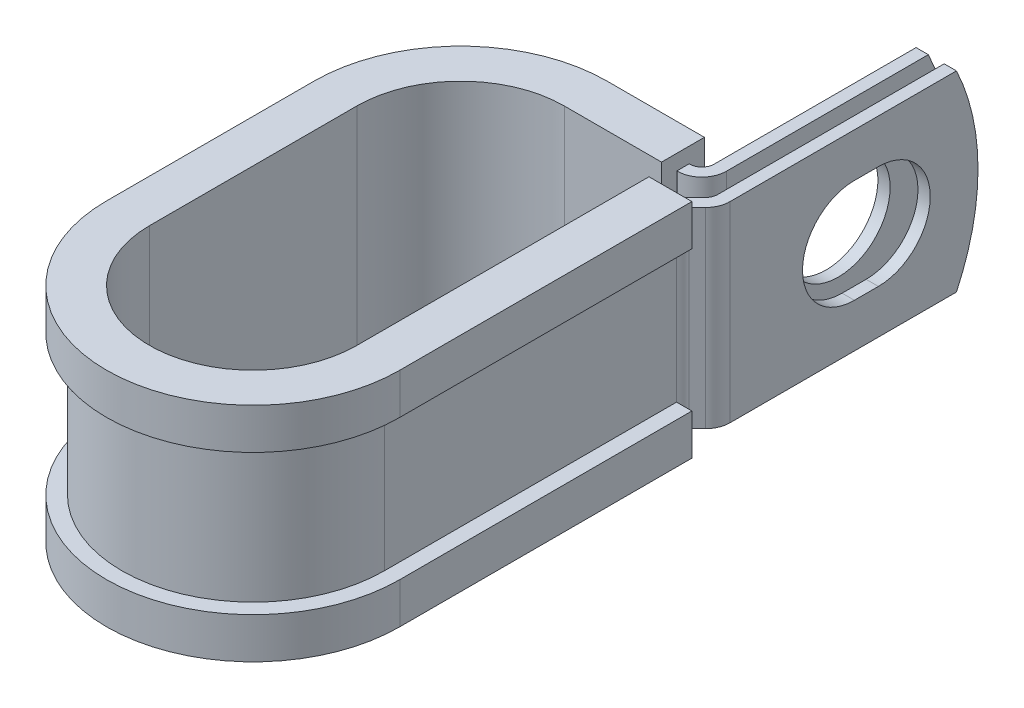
ISO-10303-21;
HEADER;
FILE_DESCRIPTION(('STEP AP214'),'2;1');
FILE_NAME('part.step','',(''),(''),'','','');
FILE_SCHEMA(('AUTOMOTIVE_DESIGN { 1 0 10303 214 1 1 1 1 }'));
ENDSEC;
DATA;
#1=APPLICATION_CONTEXT('core data for automotive mechanical design processes');
#2=APPLICATION_PROTOCOL_DEFINITION('international standard','automotive_design',2000,#1);
#3=PRODUCT_CONTEXT('',#1,'mechanical');
#4=PRODUCT('Part','Part','',(#3));
#5=PRODUCT_RELATED_PRODUCT_CATEGORY('part','',(#4));
#6=PRODUCT_DEFINITION_FORMATION('','',#4);
#7=PRODUCT_DEFINITION_CONTEXT('part definition',#1,'design');
#8=PRODUCT_DEFINITION('design','',#6,#7);
#9=PRODUCT_DEFINITION_SHAPE('','',#8);
#10=(LENGTH_UNIT() NAMED_UNIT(*) SI_UNIT(.MILLI.,.METRE.));
#11=(NAMED_UNIT(*) PLANE_ANGLE_UNIT() SI_UNIT($,.RADIAN.));
#12=(NAMED_UNIT(*) SI_UNIT($,.STERADIAN.) SOLID_ANGLE_UNIT());
#13=UNCERTAINTY_MEASURE_WITH_UNIT(LENGTH_MEASURE(1.E-05),#10,'distance_accuracy_value','');
#14=(GEOMETRIC_REPRESENTATION_CONTEXT(3) GLOBAL_UNCERTAINTY_ASSIGNED_CONTEXT((#13)) GLOBAL_UNIT_ASSIGNED_CONTEXT((#10,
#11,#12)) REPRESENTATION_CONTEXT('',''));
#15=CARTESIAN_POINT('',(0.,0.,0.));
#16=DIRECTION('',(0.,0.,1.));
#17=DIRECTION('',(1.,0.,0.));
#18=AXIS2_PLACEMENT_3D('',#15,#16,#17);
#19=CARTESIAN_POINT('',(12.5146698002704,-9.525,-11.8364));
#20=DIRECTION('',(0.,1.,0.));
#21=DIRECTION('',(1.,0.,0.));
#22=AXIS2_PLACEMENT_3D('',#19,#20,#21);
#23=PLANE('',#22);
#24=DIRECTION('',(0.,0.,-1.));
#25=VECTOR('',#24,1.);
#26=CARTESIAN_POINT('',(9.6698698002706,-9.525,-11.8364));
#27=LINE('',#26,#25);
#28=CARTESIAN_POINT('',(9.6698698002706,-9.525,-11.8364));
#29=VERTEX_POINT('',#28);
#30=CARTESIAN_POINT('',(9.66986980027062,-9.525,-13.0556));
#31=VERTEX_POINT('',#30);
#32=EDGE_CURVE('E564',#29,#31,#27,.T.);
#33=ORIENTED_EDGE('',*,*,#32,.T.);
#34=DIRECTION('',(-1.,0.,0.));
#35=VECTOR('',#34,1.);
#36=CARTESIAN_POINT('',(0.,-9.525,-13.0556));
#37=LINE('',#36,#35);
#38=CARTESIAN_POINT('',(9.72066980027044,-9.525,-13.0556));
#39=VERTEX_POINT('',#38);
#40=EDGE_CURVE('E398',#39,#31,#37,.T.);
#41=ORIENTED_EDGE('',*,*,#40,.F.);
#42=CARTESIAN_POINT('',(9.72066980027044,-9.525,-14.2748));
#43=DIRECTION('',(0.,1.,0.));
#44=DIRECTION('',(1.,0.,0.));
#45=AXIS2_PLACEMENT_3D('',#42,#43,#44);
#46=CIRCLE('',#45,1.2192);
#47=CARTESIAN_POINT('',(10.9398698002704,-9.525,-14.2748));
#48=VERTEX_POINT('',#47);
#49=EDGE_CURVE('E396',#48,#39,#46,.F.);
#50=ORIENTED_EDGE('',*,*,#49,.F.);
#51=DIRECTION('',(0.,0.,1.));
#52=VECTOR('',#51,1.);
#53=CARTESIAN_POINT('',(10.9398698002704,-9.525,-36.4998));
#54=LINE('',#53,#52);
#55=CARTESIAN_POINT('',(10.9398698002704,-9.525,-34.3552631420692));
#56=VERTEX_POINT('',#55);
#57=EDGE_CURVE('E394',#56,#48,#54,.T.);
#58=ORIENTED_EDGE('',*,*,#57,.F.);
#59=DIRECTION('',(-1.,0.,0.));
#60=VECTOR('',#59,1.);
#61=CARTESIAN_POINT('',(14.9530698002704,-9.525,-34.3552631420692));
#62=LINE('',#61,#60);
#63=CARTESIAN_POINT('',(12.1590698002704,-9.525,-34.3552631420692));
#64=VERTEX_POINT('',#63);
#65=EDGE_CURVE('E12',#64,#56,#62,.T.);
#66=ORIENTED_EDGE('',*,*,#65,.F.);
#67=DIRECTION('',(0.,0.,1.));
#68=VECTOR('',#67,1.);
#69=CARTESIAN_POINT('',(12.1590698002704,-9.525,-36.4998));
#70=LINE('',#69,#68);
#71=CARTESIAN_POINT('',(12.1590698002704,-9.525,-14.2748));
#72=VERTEX_POINT('',#71);
#73=EDGE_CURVE('E392',#64,#72,#70,.T.);
#74=ORIENTED_EDGE('',*,*,#73,.T.);
#75=CARTESIAN_POINT('',(9.72066980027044,-9.525,-14.2748));
#76=DIRECTION('',(0.,-1.,0.));
#77=DIRECTION('',(0.,0.,1.));
#78=AXIS2_PLACEMENT_3D('',#75,#76,#77);
#79=CIRCLE('',#78,2.4384);
#80=CARTESIAN_POINT('',(9.72066980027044,-9.525,-11.8364));
#81=VERTEX_POINT('',#80);
#82=EDGE_CURVE('E389',#72,#81,#79,.T.);
#83=ORIENTED_EDGE('',*,*,#82,.T.);
#84=DIRECTION('',(-1.,0.,0.));
#85=VECTOR('',#84,1.);
#86=CARTESIAN_POINT('',(0.,-9.525,-11.8364));
#87=LINE('',#86,#85);
#88=EDGE_CURVE('E386',#81,#29,#87,.T.);
#89=ORIENTED_EDGE('',*,*,#88,.T.);
#90=EDGE_LOOP('',(#33,#41,#50,#58,#66,#74,#83,#89));
#91=FACE_BOUND('',#90,.T.);
#92=ADVANCED_FACE('F37',(#91),#23,.F.);
#93=CARTESIAN_POINT('',(12.5146698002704,9.525,-11.8364));
#94=DIRECTION('',(0.,1.,0.));
#95=DIRECTION('',(1.,0.,0.));
#96=AXIS2_PLACEMENT_3D('',#93,#94,#95);
#97=PLANE('',#96);
#98=DIRECTION('',(-1.,0.,0.));
#99=VECTOR('',#98,1.);
#100=CARTESIAN_POINT('',(0.,9.525,-13.0556));
#101=LINE('',#100,#99);
#102=CARTESIAN_POINT('',(9.72066980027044,9.525,-13.0556));
#103=VERTEX_POINT('',#102);
#104=CARTESIAN_POINT('',(9.66986980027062,9.525,-13.0556));
#105=VERTEX_POINT('',#104);
#106=EDGE_CURVE('E359',#103,#105,#101,.T.);
#107=ORIENTED_EDGE('',*,*,#106,.T.);
#108=DIRECTION('',(0.,0.,1.));
#109=VECTOR('',#108,1.);
#110=CARTESIAN_POINT('',(9.66986980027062,9.525,-13.0556));
#111=LINE('',#110,#109);
#112=CARTESIAN_POINT('',(9.6698698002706,9.525,-11.8364));
#113=VERTEX_POINT('',#112);
#114=EDGE_CURVE('E570',#105,#113,#111,.T.);
#115=ORIENTED_EDGE('',*,*,#114,.T.);
#116=DIRECTION('',(-1.,0.,0.));
#117=VECTOR('',#116,1.);
#118=CARTESIAN_POINT('',(0.,9.525,-11.8364));
#119=LINE('',#118,#117);
#120=CARTESIAN_POINT('',(9.72066980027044,9.525,-11.8364));
#121=VERTEX_POINT('',#120);
#122=EDGE_CURVE('E461',#121,#113,#119,.T.);
#123=ORIENTED_EDGE('',*,*,#122,.F.);
#124=CARTESIAN_POINT('',(9.72066980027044,9.525,-14.2748));
#125=DIRECTION('',(0.,-1.,0.));
#126=DIRECTION('',(0.,0.,1.));
#127=AXIS2_PLACEMENT_3D('',#124,#125,#126);
#128=CIRCLE('',#127,2.4384);
#129=CARTESIAN_POINT('',(12.1590698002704,9.525,-14.2748));
#130=VERTEX_POINT('',#129);
#131=EDGE_CURVE('E456',#130,#121,#128,.T.);
#132=ORIENTED_EDGE('',*,*,#131,.F.);
#133=DIRECTION('',(0.,0.,1.));
#134=VECTOR('',#133,1.);
#135=CARTESIAN_POINT('',(12.1590698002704,9.525,-36.4998));
#136=LINE('',#135,#134);
#137=CARTESIAN_POINT('',(12.1590698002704,9.525,-34.3552631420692));
#138=VERTEX_POINT('',#137);
#139=EDGE_CURVE('E450',#138,#130,#136,.T.);
#140=ORIENTED_EDGE('',*,*,#139,.F.);
#141=DIRECTION('',(-1.,0.,0.));
#142=VECTOR('',#141,1.);
#143=CARTESIAN_POINT('',(14.9530698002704,9.525,-34.3552631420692));
#144=LINE('',#143,#142);
#145=CARTESIAN_POINT('',(10.9398698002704,9.525,-34.3552631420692));
#146=VERTEX_POINT('',#145);
#147=EDGE_CURVE('E45',#138,#146,#144,.T.);
#148=ORIENTED_EDGE('',*,*,#147,.T.);
#149=DIRECTION('',(0.,0.,1.));
#150=VECTOR('',#149,1.);
#151=CARTESIAN_POINT('',(10.9398698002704,9.525,-36.4998));
#152=LINE('',#151,#150);
#153=CARTESIAN_POINT('',(10.9398698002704,9.525,-14.2748));
#154=VERTEX_POINT('',#153);
#155=EDGE_CURVE('E447',#146,#154,#152,.T.);
#156=ORIENTED_EDGE('',*,*,#155,.T.);
#157=CARTESIAN_POINT('',(9.72066980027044,9.525,-14.2748));
#158=DIRECTION('',(0.,1.,0.));
#159=DIRECTION('',(1.,0.,0.));
#160=AXIS2_PLACEMENT_3D('',#157,#158,#159);
#161=CIRCLE('',#160,1.2192);
#162=EDGE_CURVE('E364',#154,#103,#161,.F.);
#163=ORIENTED_EDGE('',*,*,#162,.T.);
#164=EDGE_LOOP('',(#107,#115,#123,#132,#140,#148,#156,#163));
#165=FACE_BOUND('',#164,.T.);
#166=ADVANCED_FACE('F446',(#165),#97,.T.);
#167=CARTESIAN_POINT('',(0.,9.525,-11.8364));
#168=DIRECTION('',(0.,0.,1.));
#169=DIRECTION('',(1.,0.,0.));
#170=AXIS2_PLACEMENT_3D('',#167,#168,#169);
#171=PLANE('',#170);
#172=ORIENTED_EDGE('',*,*,#122,.T.);
#173=DIRECTION('',(0.,-1.,0.));
#174=VECTOR('',#173,1.);
#175=CARTESIAN_POINT('',(9.6698698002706,9.525,-11.8364));
#176=LINE('',#175,#174);
#177=EDGE_CURVE('E567',#113,#29,#176,.T.);
#178=ORIENTED_EDGE('',*,*,#177,.T.);
#179=ORIENTED_EDGE('',*,*,#88,.F.);
#180=DIRECTION('',(0.,-1.,0.));
#181=VECTOR('',#180,1.);
#182=CARTESIAN_POINT('',(9.72066980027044,9.525,-11.8364));
#183=LINE('',#182,#181);
#184=EDGE_CURVE('E434',#121,#81,#183,.T.);
#185=ORIENTED_EDGE('',*,*,#184,.F.);
#186=EDGE_LOOP('',(#172,#178,#179,#185));
#187=FACE_BOUND('',#186,.T.);
#188=ADVANCED_FACE('F771',(#187),#171,.T.);
#189=CARTESIAN_POINT('',(14.9530698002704,9.525,-11.8364));
#190=DIRECTION('',(-1.,0.,0.));
#191=DIRECTION('',(0.,0.,1.));
#192=AXIS2_PLACEMENT_3D('',#189,#190,#191);
#193=PLANE('',#192);
#194=CARTESIAN_POINT('',(14.9530698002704,0.,-26.5937999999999));
#195=DIRECTION('',(1.,0.,0.));
#196=DIRECTION('',(0.,0.,-1.));
#197=AXIS2_PLACEMENT_3D('',#194,#195,#196);
#198=CIRCLE('',#197,5.1562);
#199=CARTESIAN_POINT('',(14.9530698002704,-5.1562,-26.5938000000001));
#200=VERTEX_POINT('',#199);
#201=CARTESIAN_POINT('',(14.9530698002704,5.1562,-26.5938000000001));
#202=VERTEX_POINT('',#201);
#203=EDGE_CURVE('E509',#200,#202,#198,.T.);
#204=ORIENTED_EDGE('',*,*,#203,.F.);
#205=DIRECTION('',(0.,0.,-1.));
#206=VECTOR('',#205,1.);
#207=CARTESIAN_POINT('',(14.9530698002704,-5.1562,-24.2061999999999));
#208=LINE('',#207,#206);
#209=CARTESIAN_POINT('',(14.9530698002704,-5.1562,-24.2061999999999));
#210=VERTEX_POINT('',#209);
#211=EDGE_CURVE('E506',#210,#200,#208,.T.);
#212=ORIENTED_EDGE('',*,*,#211,.F.);
#213=CARTESIAN_POINT('',(14.9530698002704,0.,-24.2061999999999));
#214=DIRECTION('',(1.,0.,0.));
#215=DIRECTION('',(0.,0.,-1.));
#216=AXIS2_PLACEMENT_3D('',#213,#214,#215);
#217=CIRCLE('',#216,5.1562);
#218=CARTESIAN_POINT('',(14.9530698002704,5.1562,-24.2061999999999));
#219=VERTEX_POINT('',#218);
#220=EDGE_CURVE('E503',#219,#210,#217,.T.);
#221=ORIENTED_EDGE('',*,*,#220,.F.);
#222=DIRECTION('',(0.,0.,1.));
#223=VECTOR('',#222,1.);
#224=CARTESIAN_POINT('',(14.9530698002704,5.1562,-24.2061999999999));
#225=LINE('',#224,#223);
#226=EDGE_CURVE('E502',#202,#219,#225,.T.);
#227=ORIENTED_EDGE('',*,*,#226,.F.);
#228=EDGE_LOOP('',(#204,#212,#221,#227));
#229=FACE_BOUND('',#228,.T.);
#230=DIRECTION('',(0.,0.,-1.));
#231=VECTOR('',#230,1.);
#232=CARTESIAN_POINT('',(14.9530698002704,-9.525,-11.8364));
#233=LINE('',#232,#231);
#234=CARTESIAN_POINT('',(14.9530698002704,-9.525,-11.8364));
#235=VERTEX_POINT('',#234);
#236=CARTESIAN_POINT('',(14.9530698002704,-9.525,-34.3552631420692));
#237=VERTEX_POINT('',#236);
#238=EDGE_CURVE('E370',#235,#237,#233,.T.);
#239=ORIENTED_EDGE('',*,*,#238,.T.);
#240=CARTESIAN_POINT('',(14.9530698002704,0.,-14.2748));
#241=DIRECTION('',(-1.,0.,0.));
#242=DIRECTION('',(0.,0.,1.));
#243=AXIS2_PLACEMENT_3D('',#240,#241,#242);
#244=CIRCLE('',#243,22.225);
#245=CARTESIAN_POINT('',(14.9530698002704,9.525,-34.3552631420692));
#246=VERTEX_POINT('',#245);
#247=EDGE_CURVE('E518',#246,#237,#244,.T.);
#248=ORIENTED_EDGE('',*,*,#247,.F.);
#249=DIRECTION('',(0.,0.,-1.));
#250=VECTOR('',#249,1.);
#251=CARTESIAN_POINT('',(14.9530698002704,9.525,-11.8364));
#252=LINE('',#251,#250);
#253=CARTESIAN_POINT('',(14.9530698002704,9.525,-11.8364));
#254=VERTEX_POINT('',#253);
#255=EDGE_CURVE('E407',#254,#246,#252,.T.);
#256=ORIENTED_EDGE('',*,*,#255,.F.);
#257=DIRECTION('',(0.,-1.,0.));
#258=VECTOR('',#257,1.);
#259=CARTESIAN_POINT('',(14.9530698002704,9.525,-11.8364));
#260=LINE('',#259,#258);
#261=EDGE_CURVE('E369',#254,#235,#260,.T.);
#262=ORIENTED_EDGE('',*,*,#261,.T.);
#263=EDGE_LOOP('',(#239,#248,#256,#262));
#264=FACE_BOUND('',#263,.T.);
#265=ADVANCED_FACE('F39',(#229,#264),#193,.F.);
#266=CARTESIAN_POINT('',(13.7338698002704,9.525,-11.8364));
#267=DIRECTION('',(-1.,0.,0.));
#268=DIRECTION('',(0.,0.,1.));
#269=AXIS2_PLACEMENT_3D('',#266,#267,#268);
#270=PLANE('',#269);
#271=DIRECTION('',(0.,0.,-1.));
#272=VECTOR('',#271,1.);
#273=CARTESIAN_POINT('',(13.7338698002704,-5.1562,-24.2061999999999));
#274=LINE('',#273,#272);
#275=CARTESIAN_POINT('',(13.7338698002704,-5.1562,-24.2061999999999));
#276=VERTEX_POINT('',#275);
#277=CARTESIAN_POINT('',(13.7338698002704,-5.1562,-26.5938000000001));
#278=VERTEX_POINT('',#277);
#279=EDGE_CURVE('E487',#276,#278,#274,.T.);
#280=ORIENTED_EDGE('',*,*,#279,.T.);
#281=CARTESIAN_POINT('',(13.7338698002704,0.,-26.5937999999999));
#282=DIRECTION('',(-1.,0.,0.));
#283=DIRECTION('',(0.,0.,1.));
#284=AXIS2_PLACEMENT_3D('',#281,#282,#283);
#285=CIRCLE('',#284,5.1562);
#286=CARTESIAN_POINT('',(13.7338698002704,5.1562,-26.5938000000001));
#287=VERTEX_POINT('',#286);
#288=EDGE_CURVE('E486',#278,#287,#285,.F.);
#289=ORIENTED_EDGE('',*,*,#288,.T.);
#290=DIRECTION('',(0.,0.,1.));
#291=VECTOR('',#290,1.);
#292=CARTESIAN_POINT('',(13.7338698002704,5.1562,-24.2061999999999));
#293=LINE('',#292,#291);
#294=CARTESIAN_POINT('',(13.7338698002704,5.1562,-24.2061999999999));
#295=VERTEX_POINT('',#294);
#296=EDGE_CURVE('E490',#287,#295,#293,.T.);
#297=ORIENTED_EDGE('',*,*,#296,.T.);
#298=CARTESIAN_POINT('',(13.7338698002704,0.,-24.2061999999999));
#299=DIRECTION('',(-1.,0.,0.));
#300=DIRECTION('',(0.,0.,1.));
#301=AXIS2_PLACEMENT_3D('',#298,#299,#300);
#302=CIRCLE('',#301,5.1562);
#303=EDGE_CURVE('E483',#295,#276,#302,.F.);
#304=ORIENTED_EDGE('',*,*,#303,.T.);
#305=EDGE_LOOP('',(#280,#289,#297,#304));
#306=FACE_BOUND('',#305,.T.);
#307=CARTESIAN_POINT('',(13.7338698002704,0.,-14.2748));
#308=DIRECTION('',(-1.,0.,0.));
#309=DIRECTION('',(0.,0.,1.));
#310=AXIS2_PLACEMENT_3D('',#307,#308,#309);
#311=CIRCLE('',#310,22.225);
#312=CARTESIAN_POINT('',(13.7338698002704,9.525,-34.3552631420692));
#313=VERTEX_POINT('',#312);
#314=CARTESIAN_POINT('',(13.7338698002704,-9.525,-34.3552631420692));
#315=VERTEX_POINT('',#314);
#316=EDGE_CURVE('E59',#313,#315,#311,.T.);
#317=ORIENTED_EDGE('',*,*,#316,.T.);
#318=DIRECTION('',(0.,0.,-1.));
#319=VECTOR('',#318,1.);
#320=CARTESIAN_POINT('',(13.7338698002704,-9.525,-11.8364));
#321=LINE('',#320,#319);
#322=CARTESIAN_POINT('',(13.7338698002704,-9.525,-11.8364));
#323=VERTEX_POINT('',#322);
#324=EDGE_CURVE('E373',#323,#315,#321,.T.);
#325=ORIENTED_EDGE('',*,*,#324,.F.);
#326=DIRECTION('',(0.,-1.,0.));
#327=VECTOR('',#326,1.);
#328=CARTESIAN_POINT('',(13.7338698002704,9.525,-11.8364));
#329=LINE('',#328,#327);
#330=CARTESIAN_POINT('',(13.7338698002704,9.525,-11.8364));
#331=VERTEX_POINT('',#330);
#332=EDGE_CURVE('E442',#331,#323,#329,.T.);
#333=ORIENTED_EDGE('',*,*,#332,.F.);
#334=DIRECTION('',(0.,0.,-1.));
#335=VECTOR('',#334,1.);
#336=CARTESIAN_POINT('',(13.7338698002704,9.525,-11.8364));
#337=LINE('',#336,#335);
#338=EDGE_CURVE('E471',#331,#313,#337,.T.);
#339=ORIENTED_EDGE('',*,*,#338,.T.);
#340=EDGE_LOOP('',(#317,#325,#333,#339));
#341=FACE_BOUND('',#340,.T.);
#342=ADVANCED_FACE('F744',(#306,#341),#270,.T.);
#343=CARTESIAN_POINT('',(12.1590698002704,9.525,-36.4998));
#344=DIRECTION('',(1.,0.,0.));
#345=DIRECTION('',(0.,0.,-1.));
#346=AXIS2_PLACEMENT_3D('',#343,#344,#345);
#347=PLANE('',#346);
#348=CARTESIAN_POINT('',(12.1590698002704,0.,-25.4));
#349=DIRECTION('',(1.,0.,0.));
#350=DIRECTION('',(0.,0.,-1.));
#351=AXIS2_PLACEMENT_3D('',#348,#349,#350);
#352=CIRCLE('',#351,5.1562);
#353=CARTESIAN_POINT('',(12.1590698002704,0.,-30.5562));
#354=VERTEX_POINT('',#353);
#355=EDGE_CURVE('E374',#354,#354,#352,.F.);
#356=ORIENTED_EDGE('',*,*,#355,.T.);
#357=EDGE_LOOP('',(#356));
#358=FACE_BOUND('',#357,.T.);
#359=ORIENTED_EDGE('',*,*,#73,.F.);
#360=CARTESIAN_POINT('',(12.1590698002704,0.,-14.2748));
#361=DIRECTION('',(1.,0.,0.));
#362=DIRECTION('',(0.,0.,-1.));
#363=AXIS2_PLACEMENT_3D('',#360,#361,#362);
#364=CIRCLE('',#363,22.225);
#365=EDGE_CURVE('E514',#64,#138,#364,.T.);
#366=ORIENTED_EDGE('',*,*,#365,.T.);
#367=ORIENTED_EDGE('',*,*,#139,.T.);
#368=DIRECTION('',(0.,-1.,0.));
#369=VECTOR('',#368,1.);
#370=CARTESIAN_POINT('',(12.1590698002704,9.525,-14.2748));
#371=LINE('',#370,#369);
#372=EDGE_CURVE('E431',#130,#72,#371,.T.);
#373=ORIENTED_EDGE('',*,*,#372,.T.);
#374=EDGE_LOOP('',(#359,#366,#367,#373));
#375=FACE_BOUND('',#374,.T.);
#376=ADVANCED_FACE('F779',(#358,#375),#347,.T.);
#377=CARTESIAN_POINT('',(10.9398698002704,9.525,-36.4998));
#378=DIRECTION('',(1.,0.,0.));
#379=DIRECTION('',(0.,0.,-1.));
#380=AXIS2_PLACEMENT_3D('',#377,#378,#379);
#381=PLANE('',#380);
#382=CARTESIAN_POINT('',(10.9398698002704,0.,-25.4));
#383=DIRECTION('',(-1.,0.,0.));
#384=DIRECTION('',(0.,0.,1.));
#385=AXIS2_PLACEMENT_3D('',#382,#383,#384);
#386=CIRCLE('',#385,5.1562);
#387=CARTESIAN_POINT('',(10.9398698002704,0.,-20.2438));
#388=VERTEX_POINT('',#387);
#389=EDGE_CURVE('E478',#388,#388,#386,.T.);
#390=ORIENTED_EDGE('',*,*,#389,.F.);
#391=EDGE_LOOP('',(#390));
#392=FACE_BOUND('',#391,.T.);
#393=CARTESIAN_POINT('',(10.9398698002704,0.,-14.2748));
#394=DIRECTION('',(-1.,0.,0.));
#395=DIRECTION('',(0.,0.,1.));
#396=AXIS2_PLACEMENT_3D('',#393,#394,#395);
#397=CIRCLE('',#396,22.225);
#398=EDGE_CURVE('E51',#146,#56,#397,.T.);
#399=ORIENTED_EDGE('',*,*,#398,.T.);
#400=ORIENTED_EDGE('',*,*,#57,.T.);
#401=DIRECTION('',(0.,-1.,0.));
#402=VECTOR('',#401,1.);
#403=CARTESIAN_POINT('',(10.9398698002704,9.525,-14.2748));
#404=LINE('',#403,#402);
#405=EDGE_CURVE('E428',#154,#48,#404,.T.);
#406=ORIENTED_EDGE('',*,*,#405,.F.);
#407=ORIENTED_EDGE('',*,*,#155,.F.);
#408=EDGE_LOOP('',(#399,#400,#406,#407));
#409=FACE_BOUND('',#408,.T.);
#410=ADVANCED_FACE('F453',(#392,#409),#381,.F.);
#411=CARTESIAN_POINT('',(14.2748,-9.525,-8.42390267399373));
#412=DIRECTION('',(0.,1.,0.));
#413=DIRECTION('',(1.,0.,0.));
#414=AXIS2_PLACEMENT_3D('',#411,#412,#413);
#415=CIRCLE('',#414,1.2192);
#416=CARTESIAN_POINT('',(13.0556,-9.525,-8.42390267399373));
#417=VERTEX_POINT('',#416);
#418=CARTESIAN_POINT('',(13.4126954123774,-9.525,-9.28600726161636));
#419=VERTEX_POINT('',#418);
#420=EDGE_CURVE('E401',#417,#419,#415,.F.);
#421=ORIENTED_EDGE('',*,*,#420,.F.);
#422=DIRECTION('',(1.,0.,0.));
#423=VECTOR('',#422,1.);
#424=CARTESIAN_POINT('',(11.8364,-9.525,-8.42390267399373));
#425=LINE('',#424,#423);
#426=CARTESIAN_POINT('',(11.8364,-9.525,-8.42390267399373));
#427=VERTEX_POINT('',#426);
#428=EDGE_CURVE('E352',#427,#417,#425,.T.);
#429=ORIENTED_EDGE('',*,*,#428,.F.);
#430=CARTESIAN_POINT('',(14.2748,-9.525,-8.42390267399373));
#431=DIRECTION('',(0.,-1.,0.));
#432=DIRECTION('',(0.,0.,1.));
#433=AXIS2_PLACEMENT_3D('',#430,#431,#432);
#434=CIRCLE('',#433,2.4384);
#435=CARTESIAN_POINT('',(12.5505908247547,-9.525,-10.148111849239));
#436=VERTEX_POINT('',#435);
#437=EDGE_CURVE('E383',#427,#436,#434,.T.);
#438=ORIENTED_EDGE('',*,*,#437,.T.);
#439=DIRECTION('',(0.707106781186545,0.,-0.70710678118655));
#440=VECTOR('',#439,1.);
#441=CARTESIAN_POINT('',(12.5505908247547,-9.525,-10.148111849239));
#442=LINE('',#441,#440);
#443=CARTESIAN_POINT('',(13.3767743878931,-9.525,-10.9742954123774));
#444=VERTEX_POINT('',#443);
#445=EDGE_CURVE('E380',#436,#444,#442,.T.);
#446=ORIENTED_EDGE('',*,*,#445,.T.);
#447=CARTESIAN_POINT('',(12.5146698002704,-9.525,-11.8364));
#448=DIRECTION('',(0.,1.,0.));
#449=DIRECTION('',(0.,0.,1.));
#450=AXIS2_PLACEMENT_3D('',#447,#448,#449);
#451=CIRCLE('',#450,1.2192);
#452=EDGE_CURVE('E377',#444,#323,#451,.T.);
#453=ORIENTED_EDGE('',*,*,#452,.T.);
#454=ORIENTED_EDGE('',*,*,#324,.T.);
#455=DIRECTION('',(-1.,0.,0.));
#456=VECTOR('',#455,1.);
#457=CARTESIAN_POINT('',(14.9530698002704,-9.525,-34.3552631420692));
#458=LINE('',#457,#456);
#459=EDGE_CURVE('E520',#237,#315,#458,.T.);
#460=ORIENTED_EDGE('',*,*,#459,.F.);
#461=ORIENTED_EDGE('',*,*,#238,.F.);
#462=CARTESIAN_POINT('',(12.5146698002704,-9.525,-11.8364));
#463=DIRECTION('',(0.,1.,0.));
#464=DIRECTION('',(1.,0.,0.));
#465=AXIS2_PLACEMENT_3D('',#462,#463,#464);
#466=CIRCLE('',#465,2.4384);
#467=CARTESIAN_POINT('',(14.2388789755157,-9.525,-10.1121908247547));
#468=VERTEX_POINT('',#467);
#469=EDGE_CURVE('E405',#468,#235,#466,.T.);
#470=ORIENTED_EDGE('',*,*,#469,.F.);
#471=DIRECTION('',(0.707106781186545,0.,-0.70710678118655));
#472=VECTOR('',#471,1.);
#473=CARTESIAN_POINT('',(13.4126954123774,-9.525,-9.28600726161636));
#474=LINE('',#473,#472);
#475=EDGE_CURVE('E403',#419,#468,#474,.T.);
#476=ORIENTED_EDGE('',*,*,#475,.F.);
#477=EDGE_LOOP('',(#421,#429,#438,#446,#453,#454,#460,#461,#470,#476));
#478=FACE_BOUND('',#477,.T.);
#479=ADVANCED_FACE('F725',(#478),#23,.F.);
#480=DIRECTION('',(-1.,0.,0.));
#481=VECTOR('',#480,1.);
#482=CARTESIAN_POINT('',(13.0556,9.525,-8.42390267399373));
#483=LINE('',#482,#481);
#484=CARTESIAN_POINT('',(13.0556,9.525,-8.42390267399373));
#485=VERTEX_POINT('',#484);
#486=CARTESIAN_POINT('',(11.8364,9.525,-8.42390267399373));
#487=VERTEX_POINT('',#486);
#488=EDGE_CURVE('E332',#485,#487,#483,.T.);
#489=ORIENTED_EDGE('',*,*,#488,.F.);
#490=CARTESIAN_POINT('',(14.2748,9.525,-8.42390267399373));
#491=DIRECTION('',(0.,1.,0.));
#492=DIRECTION('',(1.,0.,0.));
#493=AXIS2_PLACEMENT_3D('',#490,#491,#492);
#494=CIRCLE('',#493,1.2192);
#495=CARTESIAN_POINT('',(13.4126954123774,9.525,-9.28600726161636));
#496=VERTEX_POINT('',#495);
#497=EDGE_CURVE('E347',#485,#496,#494,.F.);
#498=ORIENTED_EDGE('',*,*,#497,.T.);
#499=DIRECTION('',(0.707106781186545,0.,-0.70710678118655));
#500=VECTOR('',#499,1.);
#501=CARTESIAN_POINT('',(13.4126954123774,9.525,-9.28600726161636));
#502=LINE('',#501,#500);
#503=CARTESIAN_POINT('',(14.2388789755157,9.525,-10.1121908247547));
#504=VERTEX_POINT('',#503);
#505=EDGE_CURVE('E358',#496,#504,#502,.T.);
#506=ORIENTED_EDGE('',*,*,#505,.T.);
#507=CARTESIAN_POINT('',(12.5146698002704,9.525,-11.8364));
#508=DIRECTION('',(0.,1.,0.));
#509=DIRECTION('',(1.,0.,0.));
#510=AXIS2_PLACEMENT_3D('',#507,#508,#509);
#511=CIRCLE('',#510,2.4384);
#512=EDGE_CURVE('E361',#504,#254,#511,.T.);
#513=ORIENTED_EDGE('',*,*,#512,.T.);
#514=ORIENTED_EDGE('',*,*,#255,.T.);
#515=DIRECTION('',(-1.,0.,0.));
#516=VECTOR('',#515,1.);
#517=CARTESIAN_POINT('',(14.9530698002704,9.525,-34.3552631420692));
#518=LINE('',#517,#516);
#519=EDGE_CURVE('E516',#246,#313,#518,.T.);
#520=ORIENTED_EDGE('',*,*,#519,.T.);
#521=ORIENTED_EDGE('',*,*,#338,.F.);
#522=CARTESIAN_POINT('',(12.5146698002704,9.525,-11.8364));
#523=DIRECTION('',(0.,1.,0.));
#524=DIRECTION('',(0.,0.,1.));
#525=AXIS2_PLACEMENT_3D('',#522,#523,#524);
#526=CIRCLE('',#525,1.2192);
#527=CARTESIAN_POINT('',(13.3767743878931,9.525,-10.9742954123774));
#528=VERTEX_POINT('',#527);
#529=EDGE_CURVE('E468',#528,#331,#526,.T.);
#530=ORIENTED_EDGE('',*,*,#529,.F.);
#531=DIRECTION('',(0.707106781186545,0.,-0.70710678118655));
#532=VECTOR('',#531,1.);
#533=CARTESIAN_POINT('',(12.5505908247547,9.525,-10.148111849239));
#534=LINE('',#533,#532);
#535=CARTESIAN_POINT('',(12.5505908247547,9.525,-10.148111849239));
#536=VERTEX_POINT('',#535);
#537=EDGE_CURVE('E465',#536,#528,#534,.T.);
#538=ORIENTED_EDGE('',*,*,#537,.F.);
#539=CARTESIAN_POINT('',(14.2748,9.525,-8.42390267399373));
#540=DIRECTION('',(0.,-1.,0.));
#541=DIRECTION('',(0.,0.,1.));
#542=AXIS2_PLACEMENT_3D('',#539,#540,#541);
#543=CIRCLE('',#542,2.4384);
#544=EDGE_CURVE('E351',#487,#536,#543,.T.);
#545=ORIENTED_EDGE('',*,*,#544,.F.);
#546=EDGE_LOOP('',(#489,#498,#506,#513,#514,#520,#521,#530,#538,#545));
#547=FACE_BOUND('',#546,.T.);
#548=ADVANCED_FACE('F346',(#547),#97,.T.);
#549=CARTESIAN_POINT('',(12.5146698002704,9.525,-11.8364));
#550=DIRECTION('',(0.,-1.,0.));
#551=DIRECTION('',(0.,0.,-1.));
#552=AXIS2_PLACEMENT_3D('',#549,#550,#551);
#553=CYLINDRICAL_SURFACE('',#552,1.2192);
#554=ORIENTED_EDGE('',*,*,#452,.F.);
#555=DIRECTION('',(0.,-1.,0.));
#556=VECTOR('',#555,1.);
#557=CARTESIAN_POINT('',(13.3767743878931,9.525,-10.9742954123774));
#558=LINE('',#557,#556);
#559=EDGE_CURVE('E440',#528,#444,#558,.T.);
#560=ORIENTED_EDGE('',*,*,#559,.F.);
#561=ORIENTED_EDGE('',*,*,#529,.T.);
#562=ORIENTED_EDGE('',*,*,#332,.T.);
#563=EDGE_LOOP('',(#554,#560,#561,#562));
#564=FACE_BOUND('',#563,.T.);
#565=ADVANCED_FACE('F747',(#564),#553,.F.);
#566=CARTESIAN_POINT('',(12.5505908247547,9.525,-10.148111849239));
#567=DIRECTION('',(-0.70710678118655,0.,-0.707106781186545));
#568=DIRECTION('',(-0.707106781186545,0.,0.70710678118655));
#569=AXIS2_PLACEMENT_3D('',#566,#567,#568);
#570=PLANE('',#569);
#571=ORIENTED_EDGE('',*,*,#445,.F.);
#572=DIRECTION('',(0.,-1.,0.));
#573=VECTOR('',#572,1.);
#574=CARTESIAN_POINT('',(12.5505908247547,9.525,-10.148111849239));
#575=LINE('',#574,#573);
#576=EDGE_CURVE('E438',#536,#436,#575,.T.);
#577=ORIENTED_EDGE('',*,*,#576,.F.);
#578=ORIENTED_EDGE('',*,*,#537,.T.);
#579=ORIENTED_EDGE('',*,*,#559,.T.);
#580=EDGE_LOOP('',(#571,#577,#578,#579));
#581=FACE_BOUND('',#580,.T.);
#582=ADVANCED_FACE('F750',(#581),#570,.T.);
#583=CARTESIAN_POINT('',(14.2748,9.525,-8.42390267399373));
#584=DIRECTION('',(0.,-1.,0.));
#585=DIRECTION('',(0.,0.,-1.));
#586=AXIS2_PLACEMENT_3D('',#583,#584,#585);
#587=CYLINDRICAL_SURFACE('',#586,2.4384);
#588=ORIENTED_EDGE('',*,*,#437,.F.);
#589=DIRECTION('',(0.,-1.,0.));
#590=VECTOR('',#589,1.);
#591=CARTESIAN_POINT('',(11.8364,9.525,-8.42390267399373));
#592=LINE('',#591,#590);
#593=EDGE_CURVE('E436',#487,#427,#592,.T.);
#594=ORIENTED_EDGE('',*,*,#593,.F.);
#595=ORIENTED_EDGE('',*,*,#544,.T.);
#596=ORIENTED_EDGE('',*,*,#576,.T.);
#597=EDGE_LOOP('',(#588,#594,#595,#596));
#598=FACE_BOUND('',#597,.T.);
#599=ADVANCED_FACE('F752',(#598),#587,.T.);
#600=CARTESIAN_POINT('',(9.72066980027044,9.525,-14.2748));
#601=DIRECTION('',(0.,-1.,0.));
#602=DIRECTION('',(0.,0.,-1.));
#603=AXIS2_PLACEMENT_3D('',#600,#601,#602);
#604=CYLINDRICAL_SURFACE('',#603,2.4384);
#605=ORIENTED_EDGE('',*,*,#82,.F.);
#606=ORIENTED_EDGE('',*,*,#372,.F.);
#607=ORIENTED_EDGE('',*,*,#131,.T.);
#608=ORIENTED_EDGE('',*,*,#184,.T.);
#609=EDGE_LOOP('',(#605,#606,#607,#608));
#610=FACE_BOUND('',#609,.T.);
#611=ADVANCED_FACE('F754',(#610),#604,.T.);
#612=CARTESIAN_POINT('',(9.72066980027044,9.525,-14.2748));
#613=DIRECTION('',(0.,-1.,0.));
#614=DIRECTION('',(0.,0.,-1.));
#615=AXIS2_PLACEMENT_3D('',#612,#613,#614);
#616=CYLINDRICAL_SURFACE('',#615,1.2192);
#617=ORIENTED_EDGE('',*,*,#49,.T.);
#618=DIRECTION('',(0.,-1.,0.));
#619=VECTOR('',#618,1.);
#620=CARTESIAN_POINT('',(9.72066980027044,9.525,-13.0556));
#621=LINE('',#620,#619);
#622=EDGE_CURVE('E425',#103,#39,#621,.T.);
#623=ORIENTED_EDGE('',*,*,#622,.F.);
#624=ORIENTED_EDGE('',*,*,#162,.F.);
#625=ORIENTED_EDGE('',*,*,#405,.T.);
#626=EDGE_LOOP('',(#617,#623,#624,#625));
#627=FACE_BOUND('',#626,.T.);
#628=ADVANCED_FACE('F760',(#627),#616,.F.);
#629=CARTESIAN_POINT('',(0.,9.525,-13.0556));
#630=DIRECTION('',(0.,0.,1.));
#631=DIRECTION('',(1.,0.,0.));
#632=AXIS2_PLACEMENT_3D('',#629,#630,#631);
#633=PLANE('',#632);
#634=DIRECTION('',(0.,-1.,0.));
#635=VECTOR('',#634,1.);
#636=CARTESIAN_POINT('',(0.,9.525,-13.0556));
#637=LINE('',#636,#635);
#638=CARTESIAN_POINT('',(1.825107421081E-13,6.985,-13.0556));
#639=VERTEX_POINT('',#638);
#640=CARTESIAN_POINT('',(1.825107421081E-13,-6.985,-13.0556));
#641=VERTEX_POINT('',#640);
#642=EDGE_CURVE('E422',#639,#641,#637,.T.);
#643=ORIENTED_EDGE('',*,*,#642,.F.);
#644=DIRECTION('',(1.,0.,0.));
#645=VECTOR('',#644,1.);
#646=CARTESIAN_POINT('',(1.825107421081E-13,6.985,-13.0556));
#647=LINE('',#646,#645);
#648=CARTESIAN_POINT('',(9.66986980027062,6.985,-13.0556));
#649=VERTEX_POINT('',#648);
#650=EDGE_CURVE('E523',#639,#649,#647,.T.);
#651=ORIENTED_EDGE('',*,*,#650,.T.);
#652=DIRECTION('',(0.,1.,0.));
#653=VECTOR('',#652,1.);
#654=CARTESIAN_POINT('',(9.66986980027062,9.525,-13.0556));
#655=LINE('',#654,#653);
#656=EDGE_CURVE('E573',#649,#105,#655,.T.);
#657=ORIENTED_EDGE('',*,*,#656,.T.);
#658=ORIENTED_EDGE('',*,*,#106,.F.);
#659=ORIENTED_EDGE('',*,*,#622,.T.);
#660=ORIENTED_EDGE('',*,*,#40,.T.);
#661=DIRECTION('',(0.,1.,0.));
#662=VECTOR('',#661,1.);
#663=CARTESIAN_POINT('',(9.66986980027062,-9.525,-13.0556));
#664=LINE('',#663,#662);
#665=CARTESIAN_POINT('',(9.66986980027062,-6.985,-13.0556));
#666=VERTEX_POINT('',#665);
#667=EDGE_CURVE('E561',#31,#666,#664,.T.);
#668=ORIENTED_EDGE('',*,*,#667,.T.);
#669=DIRECTION('',(1.,0.,0.));
#670=VECTOR('',#669,1.);
#671=CARTESIAN_POINT('',(1.825107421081E-13,-6.985,-13.0556));
#672=LINE('',#671,#670);
#673=EDGE_CURVE('E544',#641,#666,#672,.T.);
#674=ORIENTED_EDGE('',*,*,#673,.F.);
#675=EDGE_LOOP('',(#643,#651,#657,#658,#659,#660,#668,#674));
#676=FACE_BOUND('',#675,.T.);
#677=ADVANCED_FACE('F812',(#676),#633,.F.);
#678=CARTESIAN_POINT('',(0.,9.525,0.));
#679=DIRECTION('',(0.,-1.,0.));
#680=DIRECTION('',(0.,0.,-1.));
#681=AXIS2_PLACEMENT_3D('',#678,#679,#680);
#682=CYLINDRICAL_SURFACE('',#681,13.0556);
#683=DIRECTION('',(0.,-1.,0.));
#684=VECTOR('',#683,1.);
#685=CARTESIAN_POINT('',(-13.0556,9.525,0.));
#686=LINE('',#685,#684);
#687=CARTESIAN_POINT('',(-13.0556,6.985,-1.80411241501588E-13));
#688=VERTEX_POINT('',#687);
#689=CARTESIAN_POINT('',(-13.0556,-6.985,-1.80411241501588E-13));
#690=VERTEX_POINT('',#689);
#691=EDGE_CURVE('E419',#688,#690,#686,.T.);
#692=ORIENTED_EDGE('',*,*,#691,.F.);
#693=CARTESIAN_POINT('',(0.,6.985,0.));
#694=DIRECTION('',(0.,-1.,0.));
#695=DIRECTION('',(0.,0.,-1.));
#696=AXIS2_PLACEMENT_3D('',#693,#694,#695);
#697=CIRCLE('',#696,13.0556);
#698=EDGE_CURVE('E576',#688,#639,#697,.T.);
#699=ORIENTED_EDGE('',*,*,#698,.T.);
#700=ORIENTED_EDGE('',*,*,#642,.T.);
#701=CARTESIAN_POINT('',(0.,-6.985,0.));
#702=DIRECTION('',(0.,-1.,0.));
#703=DIRECTION('',(0.,0.,-1.));
#704=AXIS2_PLACEMENT_3D('',#701,#702,#703);
#705=CIRCLE('',#704,13.0556);
#706=EDGE_CURVE('E597',#690,#641,#705,.T.);
#707=ORIENTED_EDGE('',*,*,#706,.F.);
#708=EDGE_LOOP('',(#692,#699,#700,#707));
#709=FACE_BOUND('',#708,.T.);
#710=ADVANCED_FACE('F823',(#709),#682,.T.);
#711=CARTESIAN_POINT('',(-13.0556,9.525,0.));
#712=DIRECTION('',(1.,0.,0.));
#713=DIRECTION('',(0.,0.,-1.));
#714=AXIS2_PLACEMENT_3D('',#711,#712,#713);
#715=PLANE('',#714);
#716=DIRECTION('',(0.,-1.,0.));
#717=VECTOR('',#716,1.);
#718=CARTESIAN_POINT('',(-13.0556,9.525,20.6248));
#719=LINE('',#718,#717);
#720=CARTESIAN_POINT('',(-13.0556,6.985,20.6247999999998));
#721=VERTEX_POINT('',#720);
#722=CARTESIAN_POINT('',(-13.0556,-6.985,20.6247999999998));
#723=VERTEX_POINT('',#722);
#724=EDGE_CURVE('E416',#721,#723,#719,.T.);
#725=ORIENTED_EDGE('',*,*,#724,.F.);
#726=DIRECTION('',(0.,0.,-1.));
#727=VECTOR('',#726,1.);
#728=CARTESIAN_POINT('',(-13.0556,6.985,20.6247999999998));
#729=LINE('',#728,#727);
#730=EDGE_CURVE('E608',#721,#688,#729,.T.);
#731=ORIENTED_EDGE('',*,*,#730,.T.);
#732=ORIENTED_EDGE('',*,*,#691,.T.);
#733=DIRECTION('',(0.,0.,-1.));
#734=VECTOR('',#733,1.);
#735=CARTESIAN_POINT('',(-13.0556,-6.985,20.6247999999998));
#736=LINE('',#735,#734);
#737=EDGE_CURVE('E629',#723,#690,#736,.T.);
#738=ORIENTED_EDGE('',*,*,#737,.F.);
#739=EDGE_LOOP('',(#725,#731,#732,#738));
#740=FACE_BOUND('',#739,.T.);
#741=ADVANCED_FACE('F828',(#740),#715,.F.);
#742=CARTESIAN_POINT('',(0.,9.525,20.6248));
#743=DIRECTION('',(0.,-1.,0.));
#744=DIRECTION('',(0.,0.,-1.));
#745=AXIS2_PLACEMENT_3D('',#742,#743,#744);
#746=CYLINDRICAL_SURFACE('',#745,13.0556);
#747=DIRECTION('',(0.,-1.,0.));
#748=VECTOR('',#747,1.);
#749=CARTESIAN_POINT('',(13.0556,9.525,20.6248));
#750=LINE('',#749,#748);
#751=CARTESIAN_POINT('',(13.0556,6.985,20.6248));
#752=VERTEX_POINT('',#751);
#753=CARTESIAN_POINT('',(13.0556,-6.985,20.6248));
#754=VERTEX_POINT('',#753);
#755=EDGE_CURVE('E341',#752,#754,#750,.T.);
#756=ORIENTED_EDGE('',*,*,#755,.F.);
#757=CARTESIAN_POINT('',(0.,6.985,20.6248));
#758=DIRECTION('',(0.,-1.,0.));
#759=DIRECTION('',(0.,0.,-1.));
#760=AXIS2_PLACEMENT_3D('',#757,#758,#759);
#761=CIRCLE('',#760,13.0556);
#762=EDGE_CURVE('E640',#752,#721,#761,.T.);
#763=ORIENTED_EDGE('',*,*,#762,.T.);
#764=ORIENTED_EDGE('',*,*,#724,.T.);
#765=CARTESIAN_POINT('',(0.,-6.985,20.6248));
#766=DIRECTION('',(0.,-1.,0.));
#767=DIRECTION('',(0.,0.,-1.));
#768=AXIS2_PLACEMENT_3D('',#765,#766,#767);
#769=CIRCLE('',#768,13.0556);
#770=EDGE_CURVE('E661',#754,#723,#769,.T.);
#771=ORIENTED_EDGE('',*,*,#770,.F.);
#772=EDGE_LOOP('',(#756,#763,#764,#771));
#773=FACE_BOUND('',#772,.T.);
#774=ADVANCED_FACE('F833',(#773),#746,.T.);
#775=CARTESIAN_POINT('',(13.0556,9.525,0.));
#776=DIRECTION('',(-1.,0.,0.));
#777=DIRECTION('',(0.,0.,1.));
#778=AXIS2_PLACEMENT_3D('',#775,#776,#777);
#779=PLANE('',#778);
#780=DIRECTION('',(0.,-1.,0.));
#781=VECTOR('',#780,1.);
#782=CARTESIAN_POINT('',(13.0556,9.525,-8.42390267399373));
#783=LINE('',#782,#781);
#784=CARTESIAN_POINT('',(13.0556,6.985,-8.42390267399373));
#785=VERTEX_POINT('',#784);
#786=CARTESIAN_POINT('',(13.0556,-6.985,-8.42390267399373));
#787=VERTEX_POINT('',#786);
#788=EDGE_CURVE('E342',#785,#787,#783,.T.);
#789=ORIENTED_EDGE('',*,*,#788,.F.);
#790=DIRECTION('',(0.,0.,-1.));
#791=VECTOR('',#790,1.);
#792=CARTESIAN_POINT('',(13.0556,6.985,0.));
#793=LINE('',#792,#791);
#794=EDGE_CURVE('E681',#752,#785,#793,.T.);
#795=ORIENTED_EDGE('',*,*,#794,.F.);
#796=ORIENTED_EDGE('',*,*,#755,.T.);
#797=DIRECTION('',(0.,0.,-1.));
#798=VECTOR('',#797,1.);
#799=CARTESIAN_POINT('',(13.0556,-6.985,0.));
#800=LINE('',#799,#798);
#801=EDGE_CURVE('E682',#754,#787,#800,.T.);
#802=ORIENTED_EDGE('',*,*,#801,.T.);
#803=EDGE_LOOP('',(#789,#795,#796,#802));
#804=FACE_BOUND('',#803,.T.);
#805=ADVANCED_FACE('F836',(#804),#779,.F.);
#806=CARTESIAN_POINT('',(14.2748,9.525,-8.42390267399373));
#807=DIRECTION('',(0.,-1.,0.));
#808=DIRECTION('',(0.,0.,-1.));
#809=AXIS2_PLACEMENT_3D('',#806,#807,#808);
#810=CYLINDRICAL_SURFACE('',#809,1.2192);
#811=ORIENTED_EDGE('',*,*,#420,.T.);
#812=DIRECTION('',(0.,-1.,0.));
#813=VECTOR('',#812,1.);
#814=CARTESIAN_POINT('',(13.4126954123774,9.525,-9.28600726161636));
#815=LINE('',#814,#813);
#816=EDGE_CURVE('E356',#496,#419,#815,.T.);
#817=ORIENTED_EDGE('',*,*,#816,.F.);
#818=ORIENTED_EDGE('',*,*,#497,.F.);
#819=EDGE_CURVE('E329',#485,#785,#783,.T.);
#820=ORIENTED_EDGE('',*,*,#819,.T.);
#821=ORIENTED_EDGE('',*,*,#788,.T.);
#822=DIRECTION('',(0.,1.,0.));
#823=VECTOR('',#822,1.);
#824=CARTESIAN_POINT('',(13.0556,-9.525,-8.42390267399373));
#825=LINE('',#824,#823);
#826=EDGE_CURVE('E716',#417,#787,#825,.T.);
#827=ORIENTED_EDGE('',*,*,#826,.F.);
#828=EDGE_LOOP('',(#811,#817,#818,#820,#821,#827));
#829=FACE_BOUND('',#828,.T.);
#830=ADVANCED_FACE('F354',(#829),#810,.F.);
#831=CARTESIAN_POINT('',(13.4126954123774,9.525,-9.28600726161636));
#832=DIRECTION('',(-0.70710678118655,0.,-0.707106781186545));
#833=DIRECTION('',(-0.707106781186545,0.,0.70710678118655));
#834=AXIS2_PLACEMENT_3D('',#831,#832,#833);
#835=PLANE('',#834);
#836=ORIENTED_EDGE('',*,*,#475,.T.);
#837=DIRECTION('',(0.,-1.,0.));
#838=VECTOR('',#837,1.);
#839=CARTESIAN_POINT('',(14.2388789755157,9.525,-10.1121908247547));
#840=LINE('',#839,#838);
#841=EDGE_CURVE('E410',#504,#468,#840,.T.);
#842=ORIENTED_EDGE('',*,*,#841,.F.);
#843=ORIENTED_EDGE('',*,*,#505,.F.);
#844=ORIENTED_EDGE('',*,*,#816,.T.);
#845=EDGE_LOOP('',(#836,#842,#843,#844));
#846=FACE_BOUND('',#845,.T.);
#847=ADVANCED_FACE('F730',(#846),#835,.F.);
#848=CARTESIAN_POINT('',(12.5146698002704,9.525,-11.8364));
#849=DIRECTION('',(0.,-1.,0.));
#850=DIRECTION('',(0.,0.,-1.));
#851=AXIS2_PLACEMENT_3D('',#848,#849,#850);
#852=CYLINDRICAL_SURFACE('',#851,2.4384);
#853=ORIENTED_EDGE('',*,*,#469,.T.);
#854=ORIENTED_EDGE('',*,*,#261,.F.);
#855=ORIENTED_EDGE('',*,*,#512,.F.);
#856=ORIENTED_EDGE('',*,*,#841,.T.);
#857=EDGE_LOOP('',(#853,#854,#855,#856));
#858=FACE_BOUND('',#857,.T.);
#859=ADVANCED_FACE('F733',(#858),#852,.T.);
#860=CARTESIAN_POINT('',(26.7430057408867,0.,-25.4));
#861=DIRECTION('',(-1.,0.,0.));
#862=DIRECTION('',(0.,0.,1.));
#863=AXIS2_PLACEMENT_3D('',#860,#861,#862);
#864=CYLINDRICAL_SURFACE('',#863,5.1562);
#865=ORIENTED_EDGE('',*,*,#389,.T.);
#866=EDGE_LOOP('',(#865));
#867=FACE_BOUND('',#866,.T.);
#868=ORIENTED_EDGE('',*,*,#355,.F.);
#869=EDGE_LOOP('',(#868));
#870=FACE_BOUND('',#869,.T.);
#871=ADVANCED_FACE('F947',(#867,#870),#864,.F.);
#872=CARTESIAN_POINT('',(-2.62570213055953,-5.1562,-24.2061999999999));
#873=DIRECTION('',(0.,-1.,0.));
#874=DIRECTION('',(0.,0.,-1.));
#875=AXIS2_PLACEMENT_3D('',#872,#873,#874);
#876=PLANE('',#875);
#877=DIRECTION('',(1.,0.,0.));
#878=VECTOR('',#877,1.);
#879=CARTESIAN_POINT('',(-2.62570213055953,-5.1562,-24.2061999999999));
#880=LINE('',#879,#878);
#881=EDGE_CURVE('E481',#276,#210,#880,.T.);
#882=ORIENTED_EDGE('',*,*,#881,.T.);
#883=ORIENTED_EDGE('',*,*,#211,.T.);
#884=DIRECTION('',(1.,0.,0.));
#885=VECTOR('',#884,1.);
#886=CARTESIAN_POINT('',(-2.62570213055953,-5.1562,-26.5938000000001));
#887=LINE('',#886,#885);
#888=EDGE_CURVE('E484',#278,#200,#887,.T.);
#889=ORIENTED_EDGE('',*,*,#888,.F.);
#890=ORIENTED_EDGE('',*,*,#279,.F.);
#891=EDGE_LOOP('',(#882,#883,#889,#890));
#892=FACE_BOUND('',#891,.T.);
#893=ADVANCED_FACE('F943',(#892),#876,.F.);
#894=CARTESIAN_POINT('',(-2.62570213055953,0.,-26.5937999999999));
#895=DIRECTION('',(1.,0.,0.));
#896=DIRECTION('',(0.,0.,-1.));
#897=AXIS2_PLACEMENT_3D('',#894,#895,#896);
#898=CYLINDRICAL_SURFACE('',#897,5.1562);
#899=ORIENTED_EDGE('',*,*,#888,.T.);
#900=ORIENTED_EDGE('',*,*,#203,.T.);
#901=DIRECTION('',(1.,0.,0.));
#902=VECTOR('',#901,1.);
#903=CARTESIAN_POINT('',(-2.62570213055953,5.1562,-26.5938000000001));
#904=LINE('',#903,#902);
#905=EDGE_CURVE('E488',#287,#202,#904,.T.);
#906=ORIENTED_EDGE('',*,*,#905,.F.);
#907=ORIENTED_EDGE('',*,*,#288,.F.);
#908=EDGE_LOOP('',(#899,#900,#906,#907));
#909=FACE_BOUND('',#908,.T.);
#910=ADVANCED_FACE('F939',(#909),#898,.F.);
#911=CARTESIAN_POINT('',(-2.62570213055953,5.1562,-24.2061999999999));
#912=DIRECTION('',(0.,1.,0.));
#913=DIRECTION('',(0.,0.,1.));
#914=AXIS2_PLACEMENT_3D('',#911,#912,#913);
#915=PLANE('',#914);
#916=ORIENTED_EDGE('',*,*,#905,.T.);
#917=ORIENTED_EDGE('',*,*,#226,.T.);
#918=DIRECTION('',(1.,0.,0.));
#919=VECTOR('',#918,1.);
#920=CARTESIAN_POINT('',(-2.62570213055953,5.1562,-24.2061999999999));
#921=LINE('',#920,#919);
#922=EDGE_CURVE('E491',#295,#219,#921,.T.);
#923=ORIENTED_EDGE('',*,*,#922,.F.);
#924=ORIENTED_EDGE('',*,*,#296,.F.);
#925=EDGE_LOOP('',(#916,#917,#923,#924));
#926=FACE_BOUND('',#925,.T.);
#927=ADVANCED_FACE('F935',(#926),#915,.F.);
#928=CARTESIAN_POINT('',(-2.62570213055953,0.,-24.2061999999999));
#929=DIRECTION('',(1.,0.,0.));
#930=DIRECTION('',(0.,0.,-1.));
#931=AXIS2_PLACEMENT_3D('',#928,#929,#930);
#932=CYLINDRICAL_SURFACE('',#931,5.1562);
#933=ORIENTED_EDGE('',*,*,#922,.T.);
#934=ORIENTED_EDGE('',*,*,#220,.T.);
#935=ORIENTED_EDGE('',*,*,#881,.F.);
#936=ORIENTED_EDGE('',*,*,#303,.F.);
#937=EDGE_LOOP('',(#933,#934,#935,#936));
#938=FACE_BOUND('',#937,.T.);
#939=ADVANCED_FACE('F932',(#938),#932,.F.);
#940=CARTESIAN_POINT('',(14.9530698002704,0.,-14.2748));
#941=DIRECTION('',(-1.,0.,0.));
#942=DIRECTION('',(0.,0.,1.));
#943=AXIS2_PLACEMENT_3D('',#940,#941,#942);
#944=CYLINDRICAL_SURFACE('',#943,22.225);
#945=ORIENTED_EDGE('',*,*,#365,.F.);
#946=ORIENTED_EDGE('',*,*,#65,.T.);
#947=ORIENTED_EDGE('',*,*,#398,.F.);
#948=ORIENTED_EDGE('',*,*,#147,.F.);
#949=EDGE_LOOP('',(#945,#946,#947,#948));
#950=FACE_BOUND('',#949,.T.);
#951=ADVANCED_FACE('F803',(#950),#944,.T.);
#952=ORIENTED_EDGE('',*,*,#519,.F.);
#953=ORIENTED_EDGE('',*,*,#247,.T.);
#954=ORIENTED_EDGE('',*,*,#459,.T.);
#955=ORIENTED_EDGE('',*,*,#316,.F.);
#956=EDGE_LOOP('',(#952,#953,#954,#955));
#957=FACE_BOUND('',#956,.T.);
#958=ADVANCED_FACE('F740',(#957),#944,.T.);
#959=CARTESIAN_POINT('',(2.03572501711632E-13,11.049,-14.5796));
#960=DIRECTION('',(0.,0.,1.));
#961=DIRECTION('',(1.,0.,0.));
#962=AXIS2_PLACEMENT_3D('',#959,#960,#961);
#963=PLANE('',#962);
#964=DIRECTION('',(0.,-1.,0.));
#965=VECTOR('',#964,1.);
#966=CARTESIAN_POINT('',(2.03572501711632E-13,11.049,-14.5796));
#967=LINE('',#966,#965);
#968=CARTESIAN_POINT('',(2.03572501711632E-13,11.049,-14.5796));
#969=VERTEX_POINT('',#968);
#970=CARTESIAN_POINT('',(2.03572501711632E-13,6.985,-14.5796));
#971=VERTEX_POINT('',#970);
#972=EDGE_CURVE('E599',#969,#971,#967,.T.);
#973=ORIENTED_EDGE('',*,*,#972,.F.);
#974=DIRECTION('',(1.,0.,0.));
#975=VECTOR('',#974,1.);
#976=CARTESIAN_POINT('',(2.03572501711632E-13,11.049,-14.5796));
#977=LINE('',#976,#975);
#978=CARTESIAN_POINT('',(9.66986980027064,11.049,-14.5796));
#979=VERTEX_POINT('',#978);
#980=EDGE_CURVE('E529',#969,#979,#977,.T.);
#981=ORIENTED_EDGE('',*,*,#980,.T.);
#982=DIRECTION('',(0.,-1.,0.));
#983=VECTOR('',#982,1.);
#984=CARTESIAN_POINT('',(9.66986980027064,11.049,-14.5796));
#985=LINE('',#984,#983);
#986=CARTESIAN_POINT('',(9.66986980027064,6.985,-14.5796));
#987=VERTEX_POINT('',#986);
#988=EDGE_CURVE('E549',#979,#987,#985,.T.);
#989=ORIENTED_EDGE('',*,*,#988,.T.);
#990=DIRECTION('',(1.,0.,0.));
#991=VECTOR('',#990,1.);
#992=CARTESIAN_POINT('',(2.03572501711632E-13,6.985,-14.5796));
#993=LINE('',#992,#991);
#994=EDGE_CURVE('E526',#971,#987,#993,.T.);
#995=ORIENTED_EDGE('',*,*,#994,.F.);
#996=EDGE_LOOP('',(#973,#981,#989,#995));
#997=FACE_BOUND('',#996,.T.);
#998=ADVANCED_FACE('F872',(#997),#963,.F.);
#999=CARTESIAN_POINT('',(1.43905685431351E-13,11.049,-10.3124));
#1000=DIRECTION('',(0.,0.,-1.));
#1001=DIRECTION('',(-1.,0.,0.));
#1002=AXIS2_PLACEMENT_3D('',#999,#1000,#1001);
#1003=PLANE('',#1002);
#1004=DIRECTION('',(0.,1.,0.));
#1005=VECTOR('',#1004,1.);
#1006=CARTESIAN_POINT('',(1.43905685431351E-13,11.049,-10.3124));
#1007=LINE('',#1006,#1005);
#1008=CARTESIAN_POINT('',(1.43905685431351E-13,-11.049,-10.3124));
#1009=VERTEX_POINT('',#1008);
#1010=CARTESIAN_POINT('',(1.43905685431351E-13,11.049,-10.3124));
#1011=VERTEX_POINT('',#1010);
#1012=EDGE_CURVE('E602',#1009,#1011,#1007,.T.);
#1013=ORIENTED_EDGE('',*,*,#1012,.F.);
#1014=DIRECTION('',(1.,0.,0.));
#1015=VECTOR('',#1014,1.);
#1016=CARTESIAN_POINT('',(1.43905685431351E-13,-11.049,-10.3124));
#1017=LINE('',#1016,#1015);
#1018=CARTESIAN_POINT('',(9.66986980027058,-11.049,-10.3124));
#1019=VERTEX_POINT('',#1018);
#1020=EDGE_CURVE('E535',#1009,#1019,#1017,.T.);
#1021=ORIENTED_EDGE('',*,*,#1020,.T.);
#1022=DIRECTION('',(0.,1.,0.));
#1023=VECTOR('',#1022,1.);
#1024=CARTESIAN_POINT('',(9.66986980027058,11.049,-10.3124));
#1025=LINE('',#1024,#1023);
#1026=CARTESIAN_POINT('',(9.66986980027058,11.049,-10.3124));
#1027=VERTEX_POINT('',#1026);
#1028=EDGE_CURVE('E553',#1019,#1027,#1025,.T.);
#1029=ORIENTED_EDGE('',*,*,#1028,.T.);
#1030=DIRECTION('',(1.,0.,0.));
#1031=VECTOR('',#1030,1.);
#1032=CARTESIAN_POINT('',(1.43905685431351E-13,11.049,-10.3124));
#1033=LINE('',#1032,#1031);
#1034=EDGE_CURVE('E532',#1011,#1027,#1033,.T.);
#1035=ORIENTED_EDGE('',*,*,#1034,.F.);
#1036=EDGE_LOOP('',(#1013,#1021,#1029,#1035));
#1037=FACE_BOUND('',#1036,.T.);
#1038=ADVANCED_FACE('F878',(#1037),#1003,.F.);
#1039=CARTESIAN_POINT('',(2.03572501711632E-13,-11.049,-14.5796));
#1040=DIRECTION('',(0.,0.,1.));
#1041=DIRECTION('',(1.,0.,0.));
#1042=AXIS2_PLACEMENT_3D('',#1039,#1040,#1041);
#1043=PLANE('',#1042);
#1044=DIRECTION('',(0.,-1.,0.));
#1045=VECTOR('',#1044,1.);
#1046=CARTESIAN_POINT('',(2.03572501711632E-13,-11.049,-14.5796));
#1047=LINE('',#1046,#1045);
#1048=CARTESIAN_POINT('',(2.03572501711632E-13,-6.985,-14.5796));
#1049=VERTEX_POINT('',#1048);
#1050=CARTESIAN_POINT('',(2.03572501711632E-13,-11.049,-14.5796));
#1051=VERTEX_POINT('',#1050);
#1052=EDGE_CURVE('E605',#1049,#1051,#1047,.T.);
#1053=ORIENTED_EDGE('',*,*,#1052,.F.);
#1054=DIRECTION('',(1.,0.,0.));
#1055=VECTOR('',#1054,1.);
#1056=CARTESIAN_POINT('',(2.03572501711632E-13,-6.985,-14.5796));
#1057=LINE('',#1056,#1055);
#1058=CARTESIAN_POINT('',(9.66986980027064,-6.985,-14.5796));
#1059=VERTEX_POINT('',#1058);
#1060=EDGE_CURVE('E541',#1049,#1059,#1057,.T.);
#1061=ORIENTED_EDGE('',*,*,#1060,.T.);
#1062=DIRECTION('',(0.,-1.,0.));
#1063=VECTOR('',#1062,1.);
#1064=CARTESIAN_POINT('',(9.66986980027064,-11.049,-14.5796));
#1065=LINE('',#1064,#1063);
#1066=CARTESIAN_POINT('',(9.66986980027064,-11.049,-14.5796));
#1067=VERTEX_POINT('',#1066);
#1068=EDGE_CURVE('E557',#1059,#1067,#1065,.T.);
#1069=ORIENTED_EDGE('',*,*,#1068,.T.);
#1070=DIRECTION('',(1.,0.,0.));
#1071=VECTOR('',#1070,1.);
#1072=CARTESIAN_POINT('',(2.03572501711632E-13,-11.049,-14.5796));
#1073=LINE('',#1072,#1071);
#1074=EDGE_CURVE('E538',#1051,#1067,#1073,.T.);
#1075=ORIENTED_EDGE('',*,*,#1074,.F.);
#1076=EDGE_LOOP('',(#1053,#1061,#1069,#1075));
#1077=FACE_BOUND('',#1076,.T.);
#1078=ADVANCED_FACE('F886',(#1077),#1043,.F.);
#1079=CARTESIAN_POINT('',(0.,9.525,0.));
#1080=DIRECTION('',(0.,-1.,0.));
#1081=DIRECTION('',(0.,0.,-1.));
#1082=AXIS2_PLACEMENT_3D('',#1079,#1080,#1081);
#1083=CYLINDRICAL_SURFACE('',#1082,14.5796);
#1084=DIRECTION('',(0.,-1.,0.));
#1085=VECTOR('',#1084,1.);
#1086=CARTESIAN_POINT('',(-14.5796,11.049,-2.0122792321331E-13));
#1087=LINE('',#1086,#1085);
#1088=CARTESIAN_POINT('',(-14.5796,11.049,-2.0122792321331E-13));
#1089=VERTEX_POINT('',#1088);
#1090=CARTESIAN_POINT('',(-14.5796,6.985,-2.0122792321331E-13));
#1091=VERTEX_POINT('',#1090);
#1092=EDGE_CURVE('E631',#1089,#1091,#1087,.T.);
#1093=ORIENTED_EDGE('',*,*,#1092,.F.);
#1094=CARTESIAN_POINT('',(0.,11.049,0.));
#1095=DIRECTION('',(0.,-1.,0.));
#1096=DIRECTION('',(0.,0.,-1.));
#1097=AXIS2_PLACEMENT_3D('',#1094,#1095,#1096);
#1098=CIRCLE('',#1097,14.5796);
#1099=EDGE_CURVE('E582',#1089,#969,#1098,.T.);
#1100=ORIENTED_EDGE('',*,*,#1099,.T.);
#1101=ORIENTED_EDGE('',*,*,#972,.T.);
#1102=CARTESIAN_POINT('',(0.,6.985,0.));
#1103=DIRECTION('',(0.,-1.,0.));
#1104=DIRECTION('',(0.,0.,-1.));
#1105=AXIS2_PLACEMENT_3D('',#1102,#1103,#1104);
#1106=CIRCLE('',#1105,14.5796);
#1107=EDGE_CURVE('E579',#1091,#971,#1106,.T.);
#1108=ORIENTED_EDGE('',*,*,#1107,.F.);
#1109=EDGE_LOOP('',(#1093,#1100,#1101,#1108));
#1110=FACE_BOUND('',#1109,.T.);
#1111=ADVANCED_FACE('F869',(#1110),#1083,.T.);
#1112=CARTESIAN_POINT('',(0.,9.525,0.));
#1113=DIRECTION('',(0.,-1.,0.));
#1114=DIRECTION('',(0.,0.,-1.));
#1115=AXIS2_PLACEMENT_3D('',#1112,#1113,#1114);
#1116=CYLINDRICAL_SURFACE('',#1115,10.3124);
#1117=DIRECTION('',(0.,1.,0.));
#1118=VECTOR('',#1117,1.);
#1119=CARTESIAN_POINT('',(-10.3124,11.049,-1.42247325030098E-13));
#1120=LINE('',#1119,#1118);
#1121=CARTESIAN_POINT('',(-10.3124,-11.049,-1.42247325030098E-13));
#1122=VERTEX_POINT('',#1121);
#1123=CARTESIAN_POINT('',(-10.3124,11.049,-1.42247325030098E-13));
#1124=VERTEX_POINT('',#1123);
#1125=EDGE_CURVE('E634',#1122,#1124,#1120,.T.);
#1126=ORIENTED_EDGE('',*,*,#1125,.F.);
#1127=CARTESIAN_POINT('',(0.,-11.049,0.));
#1128=DIRECTION('',(0.,-1.,0.));
#1129=DIRECTION('',(0.,0.,-1.));
#1130=AXIS2_PLACEMENT_3D('',#1127,#1128,#1129);
#1131=CIRCLE('',#1130,10.3124);
#1132=EDGE_CURVE('E588',#1122,#1009,#1131,.T.);
#1133=ORIENTED_EDGE('',*,*,#1132,.T.);
#1134=ORIENTED_EDGE('',*,*,#1012,.T.);
#1135=CARTESIAN_POINT('',(0.,11.049,0.));
#1136=DIRECTION('',(0.,-1.,0.));
#1137=DIRECTION('',(0.,0.,-1.));
#1138=AXIS2_PLACEMENT_3D('',#1135,#1136,#1137);
#1139=CIRCLE('',#1138,10.3124);
#1140=EDGE_CURVE('E585',#1124,#1011,#1139,.T.);
#1141=ORIENTED_EDGE('',*,*,#1140,.F.);
#1142=EDGE_LOOP('',(#1126,#1133,#1134,#1141));
#1143=FACE_BOUND('',#1142,.T.);
#1144=ADVANCED_FACE('F881',(#1143),#1116,.F.);
#1145=CARTESIAN_POINT('',(0.,9.525,0.));
#1146=DIRECTION('',(0.,-1.,0.));
#1147=DIRECTION('',(0.,0.,-1.));
#1148=AXIS2_PLACEMENT_3D('',#1145,#1146,#1147);
#1149=CYLINDRICAL_SURFACE('',#1148,14.5796);
#1150=DIRECTION('',(0.,-1.,0.));
#1151=VECTOR('',#1150,1.);
#1152=CARTESIAN_POINT('',(-14.5796,-11.049,-2.0122792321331E-13));
#1153=LINE('',#1152,#1151);
#1154=CARTESIAN_POINT('',(-14.5796,-6.985,-2.0122792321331E-13));
#1155=VERTEX_POINT('',#1154);
#1156=CARTESIAN_POINT('',(-14.5796,-11.049,-2.0122792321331E-13));
#1157=VERTEX_POINT('',#1156);
#1158=EDGE_CURVE('E637',#1155,#1157,#1153,.T.);
#1159=ORIENTED_EDGE('',*,*,#1158,.F.);
#1160=CARTESIAN_POINT('',(0.,-6.985,0.));
#1161=DIRECTION('',(0.,-1.,0.));
#1162=DIRECTION('',(0.,0.,-1.));
#1163=AXIS2_PLACEMENT_3D('',#1160,#1161,#1162);
#1164=CIRCLE('',#1163,14.5796);
#1165=EDGE_CURVE('E594',#1155,#1049,#1164,.T.);
#1166=ORIENTED_EDGE('',*,*,#1165,.T.);
#1167=ORIENTED_EDGE('',*,*,#1052,.T.);
#1168=CARTESIAN_POINT('',(0.,-11.049,0.));
#1169=DIRECTION('',(0.,-1.,0.));
#1170=DIRECTION('',(0.,0.,-1.));
#1171=AXIS2_PLACEMENT_3D('',#1168,#1169,#1170);
#1172=CIRCLE('',#1171,14.5796);
#1173=EDGE_CURVE('E591',#1157,#1051,#1172,.T.);
#1174=ORIENTED_EDGE('',*,*,#1173,.F.);
#1175=EDGE_LOOP('',(#1159,#1166,#1167,#1174));
#1176=FACE_BOUND('',#1175,.T.);
#1177=ADVANCED_FACE('F890',(#1176),#1149,.T.);
#1178=CARTESIAN_POINT('',(-14.5796,11.049,20.6247999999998));
#1179=DIRECTION('',(1.,0.,0.));
#1180=DIRECTION('',(0.,0.,-1.));
#1181=AXIS2_PLACEMENT_3D('',#1178,#1179,#1180);
#1182=PLANE('',#1181);
#1183=DIRECTION('',(0.,-1.,0.));
#1184=VECTOR('',#1183,1.);
#1185=CARTESIAN_POINT('',(-14.5796,11.049,20.6247999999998));
#1186=LINE('',#1185,#1184);
#1187=CARTESIAN_POINT('',(-14.5796,11.049,20.6247999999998));
#1188=VERTEX_POINT('',#1187);
#1189=CARTESIAN_POINT('',(-14.5796,6.985,20.6247999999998));
#1190=VERTEX_POINT('',#1189);
#1191=EDGE_CURVE('E663',#1188,#1190,#1186,.T.);
#1192=ORIENTED_EDGE('',*,*,#1191,.F.);
#1193=DIRECTION('',(0.,0.,-1.));
#1194=VECTOR('',#1193,1.);
#1195=CARTESIAN_POINT('',(-14.5796,11.049,20.6247999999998));
#1196=LINE('',#1195,#1194);
#1197=EDGE_CURVE('E614',#1188,#1089,#1196,.T.);
#1198=ORIENTED_EDGE('',*,*,#1197,.T.);
#1199=ORIENTED_EDGE('',*,*,#1092,.T.);
#1200=DIRECTION('',(0.,0.,-1.));
#1201=VECTOR('',#1200,1.);
#1202=CARTESIAN_POINT('',(-14.5796,6.985,20.6247999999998));
#1203=LINE('',#1202,#1201);
#1204=EDGE_CURVE('E611',#1190,#1091,#1203,.T.);
#1205=ORIENTED_EDGE('',*,*,#1204,.F.);
#1206=EDGE_LOOP('',(#1192,#1198,#1199,#1205));
#1207=FACE_BOUND('',#1206,.T.);
#1208=ADVANCED_FACE('F866',(#1207),#1182,.F.);
#1209=CARTESIAN_POINT('',(-10.3124,11.049,20.6247999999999));
#1210=DIRECTION('',(-1.,0.,0.));
#1211=DIRECTION('',(0.,-1.,0.));
#1212=AXIS2_PLACEMENT_3D('',#1209,#1210,#1211);
#1213=PLANE('',#1212);
#1214=DIRECTION('',(0.,1.,0.));
#1215=VECTOR('',#1214,1.);
#1216=CARTESIAN_POINT('',(-10.3124,11.049,20.6247999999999));
#1217=LINE('',#1216,#1215);
#1218=CARTESIAN_POINT('',(-10.3124,-11.049,20.6247999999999));
#1219=VERTEX_POINT('',#1218);
#1220=CARTESIAN_POINT('',(-10.3124,11.049,20.6247999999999));
#1221=VERTEX_POINT('',#1220);
#1222=EDGE_CURVE('E666',#1219,#1221,#1217,.T.);
#1223=ORIENTED_EDGE('',*,*,#1222,.F.);
#1224=DIRECTION('',(0.,0.,-1.));
#1225=VECTOR('',#1224,1.);
#1226=CARTESIAN_POINT('',(-10.3124,-11.049,20.6247999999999));
#1227=LINE('',#1226,#1225);
#1228=EDGE_CURVE('E620',#1219,#1122,#1227,.T.);
#1229=ORIENTED_EDGE('',*,*,#1228,.T.);
#1230=ORIENTED_EDGE('',*,*,#1125,.T.);
#1231=DIRECTION('',(0.,0.,-1.));
#1232=VECTOR('',#1231,1.);
#1233=CARTESIAN_POINT('',(-10.3124,11.049,20.6247999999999));
#1234=LINE('',#1233,#1232);
#1235=EDGE_CURVE('E617',#1221,#1124,#1234,.T.);
#1236=ORIENTED_EDGE('',*,*,#1235,.F.);
#1237=EDGE_LOOP('',(#1223,#1229,#1230,#1236));
#1238=FACE_BOUND('',#1237,.T.);
#1239=ADVANCED_FACE('F912',(#1238),#1213,.F.);
#1240=CARTESIAN_POINT('',(-14.5796,-11.049,20.6247999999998));
#1241=DIRECTION('',(1.,0.,0.));
#1242=DIRECTION('',(0.,0.,-1.));
#1243=AXIS2_PLACEMENT_3D('',#1240,#1241,#1242);
#1244=PLANE('',#1243);
#1245=DIRECTION('',(0.,-1.,0.));
#1246=VECTOR('',#1245,1.);
#1247=CARTESIAN_POINT('',(-14.5796,-11.049,20.6247999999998));
#1248=LINE('',#1247,#1246);
#1249=CARTESIAN_POINT('',(-14.5796,-6.985,20.6247999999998));
#1250=VERTEX_POINT('',#1249);
#1251=CARTESIAN_POINT('',(-14.5796,-11.049,20.6247999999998));
#1252=VERTEX_POINT('',#1251);
#1253=EDGE_CURVE('E669',#1250,#1252,#1248,.T.);
#1254=ORIENTED_EDGE('',*,*,#1253,.F.);
#1255=DIRECTION('',(0.,0.,-1.));
#1256=VECTOR('',#1255,1.);
#1257=CARTESIAN_POINT('',(-14.5796,-6.985,20.6247999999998));
#1258=LINE('',#1257,#1256);
#1259=EDGE_CURVE('E626',#1250,#1155,#1258,.T.);
#1260=ORIENTED_EDGE('',*,*,#1259,.T.);
#1261=ORIENTED_EDGE('',*,*,#1158,.T.);
#1262=DIRECTION('',(0.,0.,-1.));
#1263=VECTOR('',#1262,1.);
#1264=CARTESIAN_POINT('',(-14.5796,-11.049,20.6247999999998));
#1265=LINE('',#1264,#1263);
#1266=EDGE_CURVE('E623',#1252,#1157,#1265,.T.);
#1267=ORIENTED_EDGE('',*,*,#1266,.F.);
#1268=EDGE_LOOP('',(#1254,#1260,#1261,#1267));
#1269=FACE_BOUND('',#1268,.T.);
#1270=ADVANCED_FACE('F892',(#1269),#1244,.F.);
#1271=CARTESIAN_POINT('',(0.,9.525,20.6248));
#1272=DIRECTION('',(0.,-1.,0.));
#1273=DIRECTION('',(0.,0.,-1.));
#1274=AXIS2_PLACEMENT_3D('',#1271,#1272,#1273);
#1275=CYLINDRICAL_SURFACE('',#1274,14.5796);
#1276=DIRECTION('',(0.,-1.,0.));
#1277=VECTOR('',#1276,1.);
#1278=CARTESIAN_POINT('',(14.5796,11.049,20.6248));
#1279=LINE('',#1278,#1277);
#1280=CARTESIAN_POINT('',(14.5796,11.049,20.6248));
#1281=VERTEX_POINT('',#1280);
#1282=CARTESIAN_POINT('',(14.5796,6.985,20.6248));
#1283=VERTEX_POINT('',#1282);
#1284=EDGE_CURVE('E672',#1281,#1283,#1279,.T.);
#1285=ORIENTED_EDGE('',*,*,#1284,.F.);
#1286=CARTESIAN_POINT('',(0.,11.049,20.6248));
#1287=DIRECTION('',(0.,-1.,0.));
#1288=DIRECTION('',(0.,0.,-1.));
#1289=AXIS2_PLACEMENT_3D('',#1286,#1287,#1288);
#1290=CIRCLE('',#1289,14.5796);
#1291=EDGE_CURVE('E646',#1281,#1188,#1290,.T.);
#1292=ORIENTED_EDGE('',*,*,#1291,.T.);
#1293=ORIENTED_EDGE('',*,*,#1191,.T.);
#1294=CARTESIAN_POINT('',(0.,6.985,20.6248));
#1295=DIRECTION('',(0.,-1.,0.));
#1296=DIRECTION('',(0.,0.,-1.));
#1297=AXIS2_PLACEMENT_3D('',#1294,#1295,#1296);
#1298=CIRCLE('',#1297,14.5796);
#1299=EDGE_CURVE('E643',#1283,#1190,#1298,.T.);
#1300=ORIENTED_EDGE('',*,*,#1299,.F.);
#1301=EDGE_LOOP('',(#1285,#1292,#1293,#1300));
#1302=FACE_BOUND('',#1301,.T.);
#1303=ADVANCED_FACE('F863',(#1302),#1275,.T.);
#1304=CARTESIAN_POINT('',(0.,9.525,20.6248));
#1305=DIRECTION('',(0.,-1.,0.));
#1306=DIRECTION('',(0.,0.,-1.));
#1307=AXIS2_PLACEMENT_3D('',#1304,#1305,#1306);
#1308=CYLINDRICAL_SURFACE('',#1307,10.3124);
#1309=DIRECTION('',(0.,1.,0.));
#1310=VECTOR('',#1309,1.);
#1311=CARTESIAN_POINT('',(10.3124,11.049,20.6248));
#1312=LINE('',#1311,#1310);
#1313=CARTESIAN_POINT('',(10.3124,-11.049,20.6248));
#1314=VERTEX_POINT('',#1313);
#1315=CARTESIAN_POINT('',(10.3124,11.049,20.6248));
#1316=VERTEX_POINT('',#1315);
#1317=EDGE_CURVE('E675',#1314,#1316,#1312,.T.);
#1318=ORIENTED_EDGE('',*,*,#1317,.F.);
#1319=CARTESIAN_POINT('',(0.,-11.049,20.6248));
#1320=DIRECTION('',(0.,-1.,0.));
#1321=DIRECTION('',(0.,0.,-1.));
#1322=AXIS2_PLACEMENT_3D('',#1319,#1320,#1321);
#1323=CIRCLE('',#1322,10.3124);
#1324=EDGE_CURVE('E652',#1314,#1219,#1323,.T.);
#1325=ORIENTED_EDGE('',*,*,#1324,.T.);
#1326=ORIENTED_EDGE('',*,*,#1222,.T.);
#1327=CARTESIAN_POINT('',(0.,11.049,20.6248));
#1328=DIRECTION('',(0.,-1.,0.));
#1329=DIRECTION('',(0.,0.,-1.));
#1330=AXIS2_PLACEMENT_3D('',#1327,#1328,#1329);
#1331=CIRCLE('',#1330,10.3124);
#1332=EDGE_CURVE('E649',#1316,#1221,#1331,.T.);
#1333=ORIENTED_EDGE('',*,*,#1332,.F.);
#1334=EDGE_LOOP('',(#1318,#1325,#1326,#1333));
#1335=FACE_BOUND('',#1334,.T.);
#1336=ADVANCED_FACE('F896',(#1335),#1308,.F.);
#1337=CARTESIAN_POINT('',(0.,9.525,20.6248));
#1338=DIRECTION('',(0.,-1.,0.));
#1339=DIRECTION('',(0.,0.,-1.));
#1340=AXIS2_PLACEMENT_3D('',#1337,#1338,#1339);
#1341=CYLINDRICAL_SURFACE('',#1340,14.5796);
#1342=DIRECTION('',(0.,-1.,0.));
#1343=VECTOR('',#1342,1.);
#1344=CARTESIAN_POINT('',(14.5796,-11.049,20.6248));
#1345=LINE('',#1344,#1343);
#1346=CARTESIAN_POINT('',(14.5796,-6.985,20.6248));
#1347=VERTEX_POINT('',#1346);
#1348=CARTESIAN_POINT('',(14.5796,-11.049,20.6248));
#1349=VERTEX_POINT('',#1348);
#1350=EDGE_CURVE('E678',#1347,#1349,#1345,.T.);
#1351=ORIENTED_EDGE('',*,*,#1350,.F.);
#1352=CARTESIAN_POINT('',(0.,-6.985,20.6248));
#1353=DIRECTION('',(0.,-1.,0.));
#1354=DIRECTION('',(0.,0.,-1.));
#1355=AXIS2_PLACEMENT_3D('',#1352,#1353,#1354);
#1356=CIRCLE('',#1355,14.5796);
#1357=EDGE_CURVE('E658',#1347,#1250,#1356,.T.);
#1358=ORIENTED_EDGE('',*,*,#1357,.T.);
#1359=ORIENTED_EDGE('',*,*,#1253,.T.);
#1360=CARTESIAN_POINT('',(0.,-11.049,20.6248));
#1361=DIRECTION('',(0.,-1.,0.));
#1362=DIRECTION('',(0.,0.,-1.));
#1363=AXIS2_PLACEMENT_3D('',#1360,#1361,#1362);
#1364=CIRCLE('',#1363,14.5796);
#1365=EDGE_CURVE('E655',#1349,#1252,#1364,.T.);
#1366=ORIENTED_EDGE('',*,*,#1365,.F.);
#1367=EDGE_LOOP('',(#1351,#1358,#1359,#1366));
#1368=FACE_BOUND('',#1367,.T.);
#1369=ADVANCED_FACE('F894',(#1368),#1341,.T.);
#1370=CARTESIAN_POINT('',(14.5796,6.985,0.));
#1371=DIRECTION('',(0.,-1.,0.));
#1372=DIRECTION('',(0.,0.,-1.));
#1373=AXIS2_PLACEMENT_3D('',#1370,#1371,#1372);
#1374=PLANE('',#1373);
#1375=DIRECTION('',(-1.,0.,0.));
#1376=VECTOR('',#1375,1.);
#1377=CARTESIAN_POINT('',(14.5796,6.985,-8.42390267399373));
#1378=LINE('',#1377,#1376);
#1379=CARTESIAN_POINT('',(14.5796,6.985,-8.42390267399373));
#1380=VERTEX_POINT('',#1379);
#1381=EDGE_CURVE('E336',#1380,#785,#1378,.T.);
#1382=ORIENTED_EDGE('',*,*,#1381,.F.);
#1383=DIRECTION('',(0.,0.,-1.));
#1384=VECTOR('',#1383,1.);
#1385=CARTESIAN_POINT('',(14.5796,6.985,0.));
#1386=LINE('',#1385,#1384);
#1387=EDGE_CURVE('E695',#1283,#1380,#1386,.T.);
#1388=ORIENTED_EDGE('',*,*,#1387,.F.);
#1389=ORIENTED_EDGE('',*,*,#1299,.T.);
#1390=ORIENTED_EDGE('',*,*,#1204,.T.);
#1391=ORIENTED_EDGE('',*,*,#1107,.T.);
#1392=ORIENTED_EDGE('',*,*,#994,.T.);
#1393=DIRECTION('',(0.,0.,1.));
#1394=VECTOR('',#1393,1.);
#1395=CARTESIAN_POINT('',(9.66986980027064,6.985,-14.5796));
#1396=LINE('',#1395,#1394);
#1397=EDGE_CURVE('E547',#987,#649,#1396,.T.);
#1398=ORIENTED_EDGE('',*,*,#1397,.T.);
#1399=ORIENTED_EDGE('',*,*,#650,.F.);
#1400=ORIENTED_EDGE('',*,*,#698,.F.);
#1401=ORIENTED_EDGE('',*,*,#730,.F.);
#1402=ORIENTED_EDGE('',*,*,#762,.F.);
#1403=ORIENTED_EDGE('',*,*,#794,.T.);
#1404=EDGE_LOOP('',(#1382,#1388,#1389,#1390,#1391,#1392,#1398,#1399,#1400,#1401,#1402,#1403));
#1405=FACE_BOUND('',#1404,.T.);
#1406=ADVANCED_FACE('F825',(#1405),#1374,.T.);
#1407=CARTESIAN_POINT('',(14.5796,11.049,0.));
#1408=DIRECTION('',(1.,0.,0.));
#1409=DIRECTION('',(0.,0.,-1.));
#1410=AXIS2_PLACEMENT_3D('',#1407,#1408,#1409);
#1411=PLANE('',#1410);
#1412=DIRECTION('',(0.,-1.,0.));
#1413=VECTOR('',#1412,1.);
#1414=CARTESIAN_POINT('',(14.5796,11.049,-8.42390267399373));
#1415=LINE('',#1414,#1413);
#1416=CARTESIAN_POINT('',(14.5796,11.049,-8.42390267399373));
#1417=VERTEX_POINT('',#1416);
#1418=EDGE_CURVE('E699',#1417,#1380,#1415,.T.);
#1419=ORIENTED_EDGE('',*,*,#1418,.F.);
#1420=DIRECTION('',(0.,0.,-1.));
#1421=VECTOR('',#1420,1.);
#1422=CARTESIAN_POINT('',(14.5796,11.049,0.));
#1423=LINE('',#1422,#1421);
#1424=EDGE_CURVE('E693',#1281,#1417,#1423,.T.);
#1425=ORIENTED_EDGE('',*,*,#1424,.F.);
#1426=ORIENTED_EDGE('',*,*,#1284,.T.);
#1427=ORIENTED_EDGE('',*,*,#1387,.T.);
#1428=EDGE_LOOP('',(#1419,#1425,#1426,#1427));
#1429=FACE_BOUND('',#1428,.T.);
#1430=ADVANCED_FACE('F860',(#1429),#1411,.T.);
#1431=CARTESIAN_POINT('',(14.5796,11.049,0.));
#1432=DIRECTION('',(0.,1.,0.));
#1433=DIRECTION('',(0.,0.,1.));
#1434=AXIS2_PLACEMENT_3D('',#1431,#1432,#1433);
#1435=PLANE('',#1434);
#1436=DIRECTION('',(1.,0.,0.));
#1437=VECTOR('',#1436,1.);
#1438=CARTESIAN_POINT('',(14.5796,11.049,-8.42390267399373));
#1439=LINE('',#1438,#1437);
#1440=CARTESIAN_POINT('',(10.3124,11.049,-8.42390267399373));
#1441=VERTEX_POINT('',#1440);
#1442=EDGE_CURVE('E701',#1441,#1417,#1439,.T.);
#1443=ORIENTED_EDGE('',*,*,#1442,.F.);
#1444=DIRECTION('',(0.,0.,-1.));
#1445=VECTOR('',#1444,1.);
#1446=CARTESIAN_POINT('',(10.3124,11.049,0.));
#1447=LINE('',#1446,#1445);
#1448=EDGE_CURVE('E691',#1316,#1441,#1447,.T.);
#1449=ORIENTED_EDGE('',*,*,#1448,.F.);
#1450=ORIENTED_EDGE('',*,*,#1332,.T.);
#1451=ORIENTED_EDGE('',*,*,#1235,.T.);
#1452=ORIENTED_EDGE('',*,*,#1140,.T.);
#1453=ORIENTED_EDGE('',*,*,#1034,.T.);
#1454=DIRECTION('',(0.,0.,-1.));
#1455=VECTOR('',#1454,1.);
#1456=CARTESIAN_POINT('',(9.66986980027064,11.049,-14.5796));
#1457=LINE('',#1456,#1455);
#1458=EDGE_CURVE('E551',#1027,#979,#1457,.T.);
#1459=ORIENTED_EDGE('',*,*,#1458,.T.);
#1460=ORIENTED_EDGE('',*,*,#980,.F.);
#1461=ORIENTED_EDGE('',*,*,#1099,.F.);
#1462=ORIENTED_EDGE('',*,*,#1197,.F.);
#1463=ORIENTED_EDGE('',*,*,#1291,.F.);
#1464=ORIENTED_EDGE('',*,*,#1424,.T.);
#1465=EDGE_LOOP('',(#1443,#1449,#1450,#1451,#1452,#1453,#1459,#1460,#1461,#1462,#1463,#1464));
#1466=FACE_BOUND('',#1465,.T.);
#1467=ADVANCED_FACE('F855',(#1466),#1435,.T.);
#1468=CARTESIAN_POINT('',(10.3124,11.049,0.));
#1469=DIRECTION('',(-1.,0.,0.));
#1470=DIRECTION('',(0.,0.,1.));
#1471=AXIS2_PLACEMENT_3D('',#1468,#1469,#1470);
#1472=PLANE('',#1471);
#1473=DIRECTION('',(0.,1.,0.));
#1474=VECTOR('',#1473,1.);
#1475=CARTESIAN_POINT('',(10.3124,11.049,-8.42390267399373));
#1476=LINE('',#1475,#1474);
#1477=CARTESIAN_POINT('',(10.3124,-11.049,-8.42390267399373));
#1478=VERTEX_POINT('',#1477);
#1479=EDGE_CURVE('E704',#1478,#1441,#1476,.T.);
#1480=ORIENTED_EDGE('',*,*,#1479,.F.);
#1481=DIRECTION('',(0.,0.,-1.));
#1482=VECTOR('',#1481,1.);
#1483=CARTESIAN_POINT('',(10.3124,-11.049,0.));
#1484=LINE('',#1483,#1482);
#1485=EDGE_CURVE('E689',#1314,#1478,#1484,.T.);
#1486=ORIENTED_EDGE('',*,*,#1485,.F.);
#1487=ORIENTED_EDGE('',*,*,#1317,.T.);
#1488=ORIENTED_EDGE('',*,*,#1448,.T.);
#1489=EDGE_LOOP('',(#1480,#1486,#1487,#1488));
#1490=FACE_BOUND('',#1489,.T.);
#1491=ADVANCED_FACE('F851',(#1490),#1472,.T.);
#1492=CARTESIAN_POINT('',(10.3124,-11.049,0.));
#1493=DIRECTION('',(0.,-1.,0.));
#1494=DIRECTION('',(0.,0.,-1.));
#1495=AXIS2_PLACEMENT_3D('',#1492,#1493,#1494);
#1496=PLANE('',#1495);
#1497=DIRECTION('',(-1.,0.,0.));
#1498=VECTOR('',#1497,1.);
#1499=CARTESIAN_POINT('',(10.3124,-11.049,-8.42390267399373));
#1500=LINE('',#1499,#1498);
#1501=CARTESIAN_POINT('',(14.5796,-11.049,-8.42390267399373));
#1502=VERTEX_POINT('',#1501);
#1503=EDGE_CURVE('E707',#1502,#1478,#1500,.T.);
#1504=ORIENTED_EDGE('',*,*,#1503,.F.);
#1505=DIRECTION('',(0.,0.,-1.));
#1506=VECTOR('',#1505,1.);
#1507=CARTESIAN_POINT('',(14.5796,-11.049,0.));
#1508=LINE('',#1507,#1506);
#1509=EDGE_CURVE('E687',#1349,#1502,#1508,.T.);
#1510=ORIENTED_EDGE('',*,*,#1509,.F.);
#1511=ORIENTED_EDGE('',*,*,#1365,.T.);
#1512=ORIENTED_EDGE('',*,*,#1266,.T.);
#1513=ORIENTED_EDGE('',*,*,#1173,.T.);
#1514=ORIENTED_EDGE('',*,*,#1074,.T.);
#1515=DIRECTION('',(0.,0.,1.));
#1516=VECTOR('',#1515,1.);
#1517=CARTESIAN_POINT('',(9.66986980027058,-11.049,-10.3124));
#1518=LINE('',#1517,#1516);
#1519=EDGE_CURVE('E555',#1067,#1019,#1518,.T.);
#1520=ORIENTED_EDGE('',*,*,#1519,.T.);
#1521=ORIENTED_EDGE('',*,*,#1020,.F.);
#1522=ORIENTED_EDGE('',*,*,#1132,.F.);
#1523=ORIENTED_EDGE('',*,*,#1228,.F.);
#1524=ORIENTED_EDGE('',*,*,#1324,.F.);
#1525=ORIENTED_EDGE('',*,*,#1485,.T.);
#1526=EDGE_LOOP('',(#1504,#1510,#1511,#1512,#1513,#1514,#1520,#1521,#1522,#1523,#1524,#1525));
#1527=FACE_BOUND('',#1526,.T.);
#1528=ADVANCED_FACE('F846',(#1527),#1496,.T.);
#1529=CARTESIAN_POINT('',(14.5796,-11.049,0.));
#1530=DIRECTION('',(1.,0.,0.));
#1531=DIRECTION('',(0.,0.,-1.));
#1532=AXIS2_PLACEMENT_3D('',#1529,#1530,#1531);
#1533=PLANE('',#1532);
#1534=DIRECTION('',(0.,-1.,0.));
#1535=VECTOR('',#1534,1.);
#1536=CARTESIAN_POINT('',(14.5796,-11.049,-8.42390267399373));
#1537=LINE('',#1536,#1535);
#1538=CARTESIAN_POINT('',(14.5796,-6.985,-8.42390267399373));
#1539=VERTEX_POINT('',#1538);
#1540=EDGE_CURVE('E710',#1539,#1502,#1537,.T.);
#1541=ORIENTED_EDGE('',*,*,#1540,.F.);
#1542=DIRECTION('',(0.,0.,-1.));
#1543=VECTOR('',#1542,1.);
#1544=CARTESIAN_POINT('',(14.5796,-6.985,0.));
#1545=LINE('',#1544,#1543);
#1546=EDGE_CURVE('E685',#1347,#1539,#1545,.T.);
#1547=ORIENTED_EDGE('',*,*,#1546,.F.);
#1548=ORIENTED_EDGE('',*,*,#1350,.T.);
#1549=ORIENTED_EDGE('',*,*,#1509,.T.);
#1550=EDGE_LOOP('',(#1541,#1547,#1548,#1549));
#1551=FACE_BOUND('',#1550,.T.);
#1552=ADVANCED_FACE('F842',(#1551),#1533,.T.);
#1553=CARTESIAN_POINT('',(13.0556,-6.985,0.));
#1554=DIRECTION('',(0.,1.,0.));
#1555=DIRECTION('',(0.,0.,1.));
#1556=AXIS2_PLACEMENT_3D('',#1553,#1554,#1555);
#1557=PLANE('',#1556);
#1558=DIRECTION('',(1.,0.,0.));
#1559=VECTOR('',#1558,1.);
#1560=CARTESIAN_POINT('',(13.0556,-6.985,-8.42390267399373));
#1561=LINE('',#1560,#1559);
#1562=EDGE_CURVE('E713',#787,#1539,#1561,.T.);
#1563=ORIENTED_EDGE('',*,*,#1562,.F.);
#1564=ORIENTED_EDGE('',*,*,#801,.F.);
#1565=ORIENTED_EDGE('',*,*,#770,.T.);
#1566=ORIENTED_EDGE('',*,*,#737,.T.);
#1567=ORIENTED_EDGE('',*,*,#706,.T.);
#1568=ORIENTED_EDGE('',*,*,#673,.T.);
#1569=DIRECTION('',(0.,0.,-1.));
#1570=VECTOR('',#1569,1.);
#1571=CARTESIAN_POINT('',(9.66986980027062,-6.985,-13.0556));
#1572=LINE('',#1571,#1570);
#1573=EDGE_CURVE('E559',#666,#1059,#1572,.T.);
#1574=ORIENTED_EDGE('',*,*,#1573,.T.);
#1575=ORIENTED_EDGE('',*,*,#1060,.F.);
#1576=ORIENTED_EDGE('',*,*,#1165,.F.);
#1577=ORIENTED_EDGE('',*,*,#1259,.F.);
#1578=ORIENTED_EDGE('',*,*,#1357,.F.);
#1579=ORIENTED_EDGE('',*,*,#1546,.T.);
#1580=EDGE_LOOP('',(#1563,#1564,#1565,#1566,#1567,#1568,#1574,#1575,#1576,#1577,#1578,#1579));
#1581=FACE_BOUND('',#1580,.T.);
#1582=ADVANCED_FACE('F837',(#1581),#1557,.T.);
#1583=CARTESIAN_POINT('',(9.66986980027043,0.,0.));
#1584=DIRECTION('',(-1.,0.,0.));
#1585=DIRECTION('',(0.,0.,1.));
#1586=AXIS2_PLACEMENT_3D('',#1583,#1584,#1585);
#1587=PLANE('',#1586);
#1588=ORIENTED_EDGE('',*,*,#656,.F.);
#1589=ORIENTED_EDGE('',*,*,#1397,.F.);
#1590=ORIENTED_EDGE('',*,*,#988,.F.);
#1591=ORIENTED_EDGE('',*,*,#1458,.F.);
#1592=ORIENTED_EDGE('',*,*,#1028,.F.);
#1593=ORIENTED_EDGE('',*,*,#1519,.F.);
#1594=ORIENTED_EDGE('',*,*,#1068,.F.);
#1595=ORIENTED_EDGE('',*,*,#1573,.F.);
#1596=ORIENTED_EDGE('',*,*,#667,.F.);
#1597=ORIENTED_EDGE('',*,*,#32,.F.);
#1598=ORIENTED_EDGE('',*,*,#177,.F.);
#1599=ORIENTED_EDGE('',*,*,#114,.F.);
#1600=EDGE_LOOP('',(#1588,#1589,#1590,#1591,#1592,#1593,#1594,#1595,#1596,#1597,#1598,#1599));
#1601=FACE_BOUND('',#1600,.T.);
#1602=ADVANCED_FACE('F816',(#1601),#1587,.F.);
#1603=CARTESIAN_POINT('',(0.,0.,-8.42390267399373));
#1604=DIRECTION('',(0.,0.,-1.));
#1605=DIRECTION('',(-1.,0.,0.));
#1606=AXIS2_PLACEMENT_3D('',#1603,#1604,#1605);
#1607=PLANE('',#1606);
#1608=ORIENTED_EDGE('',*,*,#819,.F.);
#1609=ORIENTED_EDGE('',*,*,#488,.T.);
#1610=ORIENTED_EDGE('',*,*,#593,.T.);
#1611=ORIENTED_EDGE('',*,*,#428,.T.);
#1612=ORIENTED_EDGE('',*,*,#826,.T.);
#1613=ORIENTED_EDGE('',*,*,#1562,.T.);
#1614=ORIENTED_EDGE('',*,*,#1540,.T.);
#1615=ORIENTED_EDGE('',*,*,#1503,.T.);
#1616=ORIENTED_EDGE('',*,*,#1479,.T.);
#1617=ORIENTED_EDGE('',*,*,#1442,.T.);
#1618=ORIENTED_EDGE('',*,*,#1418,.T.);
#1619=ORIENTED_EDGE('',*,*,#1381,.T.);
#1620=EDGE_LOOP('',(#1608,#1609,#1610,#1611,#1612,#1613,#1614,#1615,#1616,#1617,#1618,#1619));
#1621=FACE_BOUND('',#1620,.T.);
#1622=ADVANCED_FACE('F331',(#1621),#1607,.T.);
#1623=CLOSED_SHELL('',(#92,#166,#188,#265,#342,#376,#410,#479,#548,#565,#582,#599,#611,#628,
#677,#710,#741,#774,#805,#830,#847,#859,#871,#893,#910,#927,#939,#951,#958,#998,#1038,#1078,
#1111,#1144,#1177,#1208,#1239,#1270,#1303,#1336,#1369,#1406,#1430,#1467,#1491,#1528,#1552,#1582,
#1602,#1622));
#1624=MANIFOLD_SOLID_BREP('B2',#1623);
#1625=ADVANCED_BREP_SHAPE_REPRESENTATION('',(#18,#1624),#14);
#1626=SHAPE_DEFINITION_REPRESENTATION(#9,#1625);
ENDSEC;
END-ISO-10303-21;
